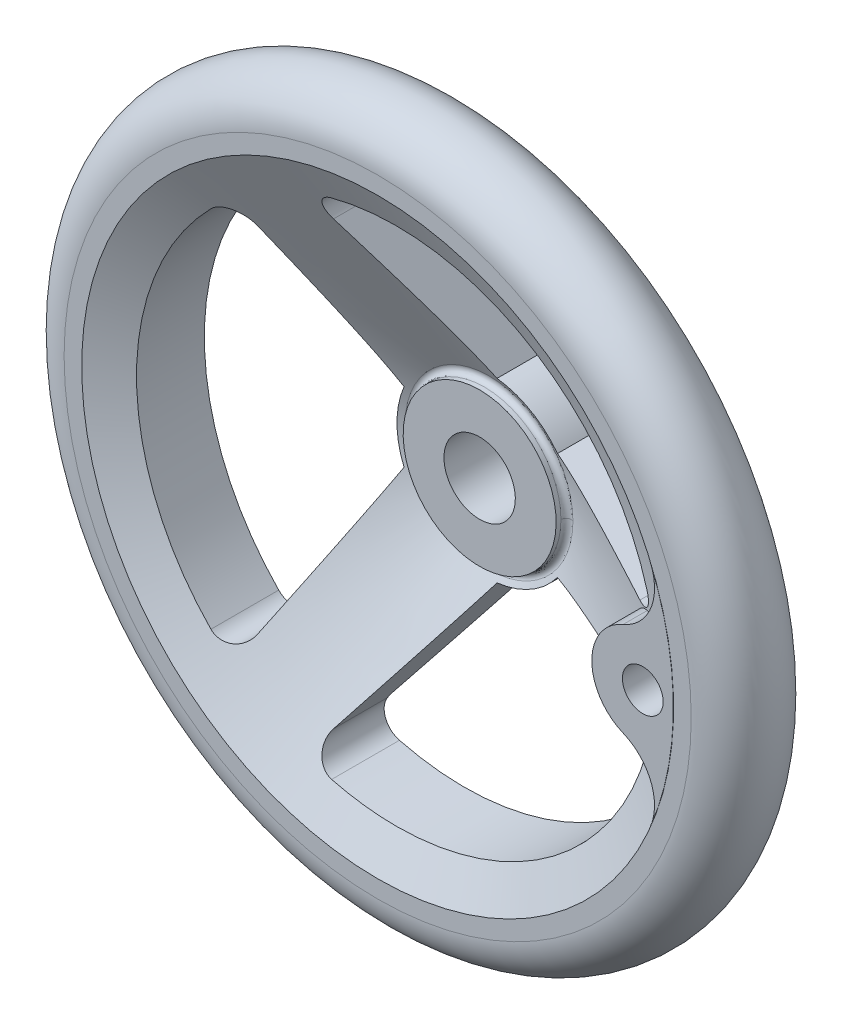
ISO-10303-21;
HEADER;
FILE_DESCRIPTION(('STEP AP214'),'2;1');
FILE_NAME('part.step','',(''),(''),'','','');
FILE_SCHEMA(('AUTOMOTIVE_DESIGN { 1 0 10303 214 1 1 1 1 }'));
ENDSEC;
DATA;
#1=APPLICATION_CONTEXT('core data for automotive mechanical design processes');
#2=APPLICATION_PROTOCOL_DEFINITION('international standard','automotive_design',2000,#1);
#3=PRODUCT_CONTEXT('',#1,'mechanical');
#4=PRODUCT('Part','Part','',(#3));
#5=PRODUCT_RELATED_PRODUCT_CATEGORY('part','',(#4));
#6=PRODUCT_DEFINITION_FORMATION('','',#4);
#7=PRODUCT_DEFINITION_CONTEXT('part definition',#1,'design');
#8=PRODUCT_DEFINITION('design','',#6,#7);
#9=PRODUCT_DEFINITION_SHAPE('','',#8);
#10=(LENGTH_UNIT() NAMED_UNIT(*) SI_UNIT(.MILLI.,.METRE.));
#11=(NAMED_UNIT(*) PLANE_ANGLE_UNIT() SI_UNIT($,.RADIAN.));
#12=(NAMED_UNIT(*) SI_UNIT($,.STERADIAN.) SOLID_ANGLE_UNIT());
#13=UNCERTAINTY_MEASURE_WITH_UNIT(LENGTH_MEASURE(1.E-05),#10,'distance_accuracy_value','');
#14=(GEOMETRIC_REPRESENTATION_CONTEXT(3) GLOBAL_UNCERTAINTY_ASSIGNED_CONTEXT((#13)) GLOBAL_UNIT_ASSIGNED_CONTEXT((#10,
#11,#12)) REPRESENTATION_CONTEXT('',''));
#15=CARTESIAN_POINT('',(0.,0.,0.));
#16=DIRECTION('',(0.,0.,1.));
#17=DIRECTION('',(1.,0.,0.));
#18=AXIS2_PLACEMENT_3D('',#15,#16,#17);
#19=CARTESIAN_POINT('',(0.,0.,0.));
#20=DIRECTION('',(0.,0.,1.));
#21=DIRECTION('',(0.,-1.,0.));
#22=AXIS2_PLACEMENT_3D('',#19,#20,#21);
#23=CYLINDRICAL_SURFACE('',#22,7.);
#24=CARTESIAN_POINT('',(0.,0.,19.000000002));
#25=DIRECTION('',(0.,0.,1.));
#26=DIRECTION('',(0.,-1.,0.));
#27=AXIS2_PLACEMENT_3D('',#24,#25,#26);
#28=CIRCLE('',#27,7.);
#29=CARTESIAN_POINT('',(0.,-7.,19.000000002));
#30=VERTEX_POINT('',#29);
#31=EDGE_CURVE('E201',#30,#30,#28,.T.);
#32=ORIENTED_EDGE('',*,*,#31,.T.);
#33=EDGE_LOOP('',(#32));
#34=FACE_BOUND('',#33,.T.);
#35=CARTESIAN_POINT('',(0.,0.,0.));
#36=DIRECTION('',(0.,0.,1.));
#37=DIRECTION('',(0.,-1.,0.));
#38=AXIS2_PLACEMENT_3D('',#35,#36,#37);
#39=CIRCLE('',#38,7.);
#40=CARTESIAN_POINT('',(0.,-7.,0.));
#41=VERTEX_POINT('',#40);
#42=EDGE_CURVE('E205',#41,#41,#39,.F.);
#43=ORIENTED_EDGE('',*,*,#42,.T.);
#44=EDGE_LOOP('',(#43));
#45=FACE_BOUND('',#44,.T.);
#46=ADVANCED_FACE('F15',(#34,#45),#23,.F.);
#47=CARTESIAN_POINT('',(-15.180469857,-15.23270539,0.));
#48=DIRECTION('',(0.,0.,1.));
#49=DIRECTION('',(1.,0.,0.));
#50=AXIS2_PLACEMENT_3D('',#47,#48,#49);
#51=PLANE('',#50);
#52=ORIENTED_EDGE('',*,*,#42,.F.);
#53=EDGE_LOOP('',(#52));
#54=FACE_BOUND('',#53,.T.);
#55=CARTESIAN_POINT('',(0.,0.,0.));
#56=DIRECTION('',(0.,0.,-1.));
#57=DIRECTION('',(-1.,0.,0.));
#58=AXIS2_PLACEMENT_3D('',#55,#56,#57);
#59=CIRCLE('',#58,16.);
#60=CARTESIAN_POINT('',(-16.,0.,0.));
#61=VERTEX_POINT('',#60);
#62=EDGE_CURVE('E208',#61,#61,#59,.T.);
#63=ORIENTED_EDGE('',*,*,#62,.T.);
#64=EDGE_LOOP('',(#63));
#65=FACE_BOUND('',#64,.T.);
#66=ADVANCED_FACE('F244',(#54,#65),#51,.F.);
#67=CARTESIAN_POINT('',(15.180469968,-15.2327055,19.000000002));
#68=DIRECTION('',(0.,0.,-1.));
#69=DIRECTION('',(-1.,0.,0.));
#70=AXIS2_PLACEMENT_3D('',#67,#68,#69);
#71=PLANE('',#70);
#72=ORIENTED_EDGE('',*,*,#31,.F.);
#73=EDGE_LOOP('',(#72));
#74=FACE_BOUND('',#73,.T.);
#75=CARTESIAN_POINT('',(0.,0.,19.000000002));
#76=DIRECTION('',(0.,0.,-1.));
#77=DIRECTION('',(0.,1.,0.));
#78=AXIS2_PLACEMENT_3D('',#75,#76,#77);
#79=CIRCLE('',#78,15.000464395);
#80=CARTESIAN_POINT('',(0.,15.000464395,19.000000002));
#81=VERTEX_POINT('',#80);
#82=EDGE_CURVE('E197',#81,#81,#79,.T.);
#83=ORIENTED_EDGE('',*,*,#82,.F.);
#84=EDGE_LOOP('',(#83));
#85=FACE_BOUND('',#84,.T.);
#86=ADVANCED_FACE('F247',(#74,#85),#71,.F.);
#87=CARTESIAN_POINT('',(44.307692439,18.461538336,34.236443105));
#88=DIRECTION('',(0.,0.,1.));
#89=DIRECTION('',(0.,-1.,0.));
#90=AXIS2_PLACEMENT_3D('',#87,#88,#89);
#91=CYLINDRICAL_SURFACE('',#90,10.);
#92=DIRECTION('',(0.,0.,-1.));
#93=VECTOR('',#92,1.);
#94=CARTESIAN_POINT('',(48.153846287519,9.2307691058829,34.7616407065));
#95=LINE('',#94,#93);
#96=CARTESIAN_POINT('',(48.1538462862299,9.23076910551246,39.));
#97=VERTEX_POINT('',#96);
#98=CARTESIAN_POINT('',(48.1538462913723,9.23076910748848,34.2648539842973));
#99=VERTEX_POINT('',#98);
#100=EDGE_CURVE('E166',#97,#99,#95,.T.);
#101=ORIENTED_EDGE('',*,*,#100,.F.);
#102=CARTESIAN_POINT('',(44.307692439,18.461538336,39.));
#103=DIRECTION('',(0.,0.,1.));
#104=DIRECTION('',(0.,-1.,0.));
#105=AXIS2_PLACEMENT_3D('',#102,#103,#104);
#106=CIRCLE('',#105,10.);
#107=CARTESIAN_POINT('',(53.5384616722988,22.3076921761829,39.));
#108=VERTEX_POINT('',#107);
#109=EDGE_CURVE('E163',#108,#97,#106,.F.);
#110=ORIENTED_EDGE('',*,*,#109,.F.);
#111=DIRECTION('',(0.,0.,1.));
#112=VECTOR('',#111,1.);
#113=CARTESIAN_POINT('',(53.5384616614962,22.3076922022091,38.9868613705));
#114=LINE('',#113,#112);
#115=CARTESIAN_POINT('',(53.5384616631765,22.3076921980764,38.9737227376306));
#116=VERTEX_POINT('',#115);
#117=EDGE_CURVE('E147',#116,#108,#114,.T.);
#118=ORIENTED_EDGE('',*,*,#117,.F.);
#119=CARTESIAN_POINT('',(53.5384616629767,22.3076921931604,38.9737227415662));
#120=CARTESIAN_POINT('',(53.63998359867,22.0641449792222,38.9737360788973));
#121=CARTESIAN_POINT('',(53.7317878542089,21.8165614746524,38.9691860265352));
#122=CARTESIAN_POINT('',(53.8954718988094,21.3152681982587,38.9510572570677));
#123=CARTESIAN_POINT('',(53.9673556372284,21.0615596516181,38.9374803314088));
#124=CARTESIAN_POINT('',(54.0905772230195,20.5505817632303,38.9014464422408));
#125=CARTESIAN_POINT('',(54.1419721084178,20.2933243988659,38.8790144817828));
#126=CARTESIAN_POINT('',(54.2243180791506,19.7764552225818,38.8254540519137));
#127=CARTESIAN_POINT('',(54.2552688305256,19.5168433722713,38.7943254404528));
#128=CARTESIAN_POINT('',(54.2967338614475,18.9972298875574,38.7236257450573));
#129=CARTESIAN_POINT('',(54.3072546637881,18.7372284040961,38.6840573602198));
#130=CARTESIAN_POINT('',(54.3081034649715,18.2185586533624,38.596769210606));
#131=CARTESIAN_POINT('',(54.2984303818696,17.9598904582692,38.5490490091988));
#132=CARTESIAN_POINT('',(54.2592909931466,17.4455515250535,38.4457873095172));
#133=CARTESIAN_POINT('',(54.22981820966,17.1898817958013,38.3902432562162));
#134=CARTESIAN_POINT('',(54.1516451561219,16.6832536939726,38.2717290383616));
#135=CARTESIAN_POINT('',(54.1029445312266,16.4322954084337,38.2087587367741));
#136=CARTESIAN_POINT('',(53.9852528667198,15.9290236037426,38.0737719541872));
#137=CARTESIAN_POINT('',(53.9156874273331,15.6769028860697,38.0015378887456));
#138=CARTESIAN_POINT('',(53.7577650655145,15.180692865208,37.8500696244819));
#139=CARTESIAN_POINT('',(53.6694017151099,14.936606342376,37.7708330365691));
#140=CARTESIAN_POINT('',(53.4749278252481,14.4579771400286,37.6058935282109));
#141=CARTESIAN_POINT('',(53.3688226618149,14.2234315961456,37.5201925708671));
#142=CARTESIAN_POINT('',(53.1398713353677,13.7649101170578,37.3427618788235));
#143=CARTESIAN_POINT('',(53.017017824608,13.5409388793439,37.2510295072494));
#144=CARTESIAN_POINT('',(52.7455751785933,13.0877877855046,37.0547263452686));
#145=CARTESIAN_POINT('',(52.5957286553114,12.8595528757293,36.9497117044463));
#146=CARTESIAN_POINT('',(52.279425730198,12.4179282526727,36.7339520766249));
#147=CARTESIAN_POINT('',(52.1129746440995,12.2045338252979,36.6232089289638));
#148=CARTESIAN_POINT('',(51.7646720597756,11.7932434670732,36.3964420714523));
#149=CARTESIAN_POINT('',(51.5828033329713,11.595365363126,36.280412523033));
#150=CARTESIAN_POINT('',(51.2053319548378,11.2162568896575,36.0438286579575));
#151=CARTESIAN_POINT('',(51.0097333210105,11.0350216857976,35.9232756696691));
#152=CARTESIAN_POINT('',(50.60734659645,10.6908207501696,35.6789144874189));
#153=CARTESIAN_POINT('',(50.4006295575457,10.5277556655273,35.5551290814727));
#154=CARTESIAN_POINT('',(49.9763432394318,10.2192569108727,35.3042101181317));
#155=CARTESIAN_POINT('',(49.7587733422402,10.0738242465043,35.1770763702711));
#156=CARTESIAN_POINT('',(49.3145990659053,9.80136407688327,34.9203080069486));
#157=CARTESIAN_POINT('',(49.0880145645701,9.67429865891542,34.7906791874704));
#158=CARTESIAN_POINT('',(48.6267154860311,9.4386146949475,34.5292552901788));
#159=CARTESIAN_POINT('',(48.3920024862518,9.32999259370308,34.3974606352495));
#160=CARTESIAN_POINT('',(48.1538462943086,9.23076910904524,34.2648539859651));
#161=B_SPLINE_CURVE_WITH_KNOTS('',3,(#119,#120,#121,#122,#123,#124,#125,#126,#127,#128,#129,
#130,#131,#132,#133,#134,#135,#136,#137,#138,#139,#140,#141,#142,#143,#144,#145,#146,#147,#148,
#149,#150,#151,#152,#153,#154,#155,#156,#157,#158,#159,#160),.UNSPECIFIED.,.F.,.F.,(4,2,2,2,2,2,
2,2,2,2,2,2,2,2,2,2,2,2,2,2,4),(0.,0.79131382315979,1.58247065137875,2.371409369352,
3.16036097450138,3.94906064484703,4.73780257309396,5.52680267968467,6.31581734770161,
7.12893550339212,7.94233215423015,8.75548277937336,9.56899130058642,10.445640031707,
11.3220090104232,12.1993705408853,13.0764764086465,13.9485229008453,14.8206191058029,
15.6908886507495,16.5609902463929),.UNSPECIFIED.);
#162=EDGE_CURVE('E181',#116,#99,#161,.T.);
#163=ORIENTED_EDGE('',*,*,#162,.T.);
#164=EDGE_LOOP('',(#101,#110,#118,#163));
#165=FACE_BOUND('',#164,.T.);
#166=ADVANCED_FACE('F164',(#165),#91,.F.);
#167=CARTESIAN_POINT('',(0.,0.,19.000000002));
#168=DIRECTION('',(0.,0.,-1.));
#169=DIRECTION('',(0.,1.,0.));
#170=AXIS2_PLACEMENT_3D('',#167,#168,#169);
#171=CYLINDRICAL_SURFACE('',#170,15.000464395);
#172=ORIENTED_EDGE('',*,*,#82,.T.);
#173=EDGE_LOOP('',(#172));
#174=FACE_BOUND('',#173,.T.);
#175=CARTESIAN_POINT('',(0.,0.,18.053702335));
#176=DIRECTION('',(0.,0.,1.));
#177=DIRECTION('',(0.,-1.,0.));
#178=AXIS2_PLACEMENT_3D('',#175,#176,#177);
#179=CIRCLE('',#178,15.000464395);
#180=CARTESIAN_POINT('',(-15.000464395,-6.734730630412E-10,18.053702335));
#181=VERTEX_POINT('',#180);
#182=CARTESIAN_POINT('',(15.000464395,-1.53832333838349E-09,18.053702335));
#183=VERTEX_POINT('',#182);
#184=EDGE_CURVE('E438',#181,#183,#179,.T.);
#185=ORIENTED_EDGE('',*,*,#184,.T.);
#186=CARTESIAN_POINT('',(0.,0.,18.053702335));
#187=DIRECTION('',(0.,0.,1.));
#188=DIRECTION('',(0.,-1.,0.));
#189=AXIS2_PLACEMENT_3D('',#186,#187,#188);
#190=CIRCLE('',#189,15.000464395);
#191=EDGE_CURVE('E171',#183,#181,#190,.T.);
#192=ORIENTED_EDGE('',*,*,#191,.T.);
#193=EDGE_LOOP('',(#185,#192));
#194=FACE_BOUND('',#193,.T.);
#195=ADVANCED_FACE('F605',(#174,#194),#171,.T.);
#196=CARTESIAN_POINT('',(-15.000464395,0.,18.053702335));
#197=CARTESIAN_POINT('',(-15.000464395,30.00092879,18.053702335));
#198=CARTESIAN_POINT('',(15.000464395,30.00092879,18.053702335));
#199=CARTESIAN_POINT('',(15.000464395,0.,18.053702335));
#200=CARTESIAN_POINT('',(-15.000464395,0.,17.212432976));
#201=CARTESIAN_POINT('',(-15.000464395,30.00092879,17.212432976));
#202=CARTESIAN_POINT('',(15.000464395,30.00092879,17.212432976));
#203=CARTESIAN_POINT('',(15.000464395,0.,17.212432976));
#204=CARTESIAN_POINT('',(-15.720432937,0.,16.777255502));
#205=CARTESIAN_POINT('',(-15.720432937,31.440865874,16.777255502));
#206=CARTESIAN_POINT('',(15.720432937,31.440865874,16.777255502));
#207=CARTESIAN_POINT('',(15.720432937,0.,16.777255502));
#208=CARTESIAN_POINT('',(-16.465293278,0.,17.168301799));
#209=CARTESIAN_POINT('',(-16.465293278,32.930586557,17.168301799));
#210=CARTESIAN_POINT('',(16.465293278,32.930586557,17.168301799));
#211=CARTESIAN_POINT('',(16.465293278,0.,17.168301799));
#212=(BOUNDED_SURFACE() B_SPLINE_SURFACE(3,3,((#196,#197,#198,#199),(#200,#201,#202,#203),(#204,
#205,#206,#207),(#208,#209,#210,#211)),.UNSPECIFIED.,.F.,.F.,
.F.) B_SPLINE_SURFACE_WITH_KNOTS((4,4),(4,4),(0.,1.),(0.,1.),
.UNSPECIFIED.) GEOMETRIC_REPRESENTATION_ITEM() RATIONAL_B_SPLINE_SURFACE(((1.,0.333333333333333,
0.333333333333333,1.),(0.678191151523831,0.22606371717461,0.22606371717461,0.678191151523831),
(0.678191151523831,0.22606371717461,0.22606371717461,0.678191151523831),(1.,0.333333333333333,
0.333333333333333,1.))) REPRESENTATION_ITEM('') SURFACE());
#213=CARTESIAN_POINT('',(0.,0.,17.168301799));
#214=DIRECTION('',(0.,0.,1.));
#215=DIRECTION('',(1.,0.,0.));
#216=AXIS2_PLACEMENT_3D('',#213,#214,#215);
#217=CIRCLE('',#216,16.465293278);
#218=CARTESIAN_POINT('',(16.465293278,-2.21771763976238E-09,17.168301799));
#219=VERTEX_POINT('',#218);
#220=CARTESIAN_POINT('',(-16.465293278,-4.22136012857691E-09,17.168301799));
#221=VERTEX_POINT('',#220);
#222=EDGE_CURVE('E453',#219,#221,#217,.T.);
#223=CARTESIAN_POINT('',(-15.000464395,0.,18.053702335));
#224=CARTESIAN_POINT('',(-15.000464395,0.,17.212432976));
#225=CARTESIAN_POINT('',(-15.720432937,0.,16.777255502));
#226=CARTESIAN_POINT('',(-16.465293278,0.,17.168301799));
#227=(BOUNDED_CURVE() B_SPLINE_CURVE(3,(#223,#224,#225,#226),.UNSPECIFIED.,.F.,
.F.) B_SPLINE_CURVE_WITH_KNOTS((4,4),(0.,1.),
.UNSPECIFIED.) CURVE() GEOMETRIC_REPRESENTATION_ITEM() RATIONAL_B_SPLINE_CURVE((1.,
0.67819115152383,0.67819115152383,1.)) REPRESENTATION_ITEM(''));
#228=EDGE_CURVE('E447',#221,#181,#227,.F.);
#229=CARTESIAN_POINT('',(15.000464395,0.,18.053702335));
#230=CARTESIAN_POINT('',(15.000464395,0.,17.212432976));
#231=CARTESIAN_POINT('',(15.720432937,0.,16.777255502));
#232=CARTESIAN_POINT('',(16.465293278,0.,17.168301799));
#233=(BOUNDED_CURVE() B_SPLINE_CURVE(3,(#229,#230,#231,#232),.UNSPECIFIED.,.F.,
.F.) B_SPLINE_CURVE_WITH_KNOTS((4,4),(0.,1.),
.UNSPECIFIED.) CURVE() GEOMETRIC_REPRESENTATION_ITEM() RATIONAL_B_SPLINE_CURVE((1.,
0.67819115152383,0.67819115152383,1.)) REPRESENTATION_ITEM(''));
#234=EDGE_CURVE('E433',#183,#219,#233,.T.);
#235=ORIENTED_EDGE('',*,*,#222,.T.);
#236=ORIENTED_EDGE('',*,*,#228,.T.);
#237=ORIENTED_EDGE('',*,*,#191,.F.);
#238=ORIENTED_EDGE('',*,*,#234,.T.);
#239=EDGE_LOOP('',(#235,#236,#237,#238));
#240=FACE_BOUND('',#239,.T.);
#241=ADVANCED_FACE('F255',(#240),#212,.F.);
#242=CARTESIAN_POINT('',(41.874692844,22.57538449,39.));
#243=DIRECTION('',(0.,0.,1.));
#244=DIRECTION('',(0.,-1.,0.));
#245=AXIS2_PLACEMENT_3D('',#242,#243,#244);
#246=PLANE('',#245);
#247=CARTESIAN_POINT('',(52.,0.,39.));
#248=DIRECTION('',(0.,0.,1.));
#249=DIRECTION('',(0.,-1.,0.));
#250=AXIS2_PLACEMENT_3D('',#247,#248,#249);
#251=CIRCLE('',#250,4.);
#252=CARTESIAN_POINT('',(52.,-4.,39.));
#253=VERTEX_POINT('',#252);
#254=EDGE_CURVE('E426',#253,#253,#251,.F.);
#255=ORIENTED_EDGE('',*,*,#254,.T.);
#256=EDGE_LOOP('',(#255));
#257=FACE_BOUND('',#256,.T.);
#258=CARTESIAN_POINT('',(44.30769235,-18.46153855,39.));
#259=DIRECTION('',(0.,0.,1.));
#260=DIRECTION('',(0.,-1.,0.));
#261=AXIS2_PLACEMENT_3D('',#258,#259,#260);
#262=CIRCLE('',#261,10.);
#263=CARTESIAN_POINT('',(48.1538462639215,-9.23076934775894,39.));
#264=VERTEX_POINT('',#263);
#265=CARTESIAN_POINT('',(53.5384615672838,-22.3076924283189,39.));
#266=VERTEX_POINT('',#265);
#267=EDGE_CURVE('E159',#264,#266,#262,.F.);
#268=ORIENTED_EDGE('',*,*,#267,.T.);
#269=CARTESIAN_POINT('',(0.,0.,39.));
#270=DIRECTION('',(0.,0.,1.));
#271=DIRECTION('',(1.,0.,0.));
#272=AXIS2_PLACEMENT_3D('',#269,#270,#271);
#273=CIRCLE('',#272,58.000000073);
#274=EDGE_CURVE('E151',#108,#266,#273,.F.);
#275=ORIENTED_EDGE('',*,*,#274,.F.);
#276=ORIENTED_EDGE('',*,*,#109,.T.);
#277=CARTESIAN_POINT('',(52.000000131,-1.26000000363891E-07,39.));
#278=DIRECTION('',(0.,0.,1.));
#279=DIRECTION('',(1.,0.,0.));
#280=AXIS2_PLACEMENT_3D('',#277,#278,#279);
#281=CIRCLE('',#280,10.);
#282=EDGE_CURVE('E170',#264,#97,#281,.F.);
#283=ORIENTED_EDGE('',*,*,#282,.F.);
#284=EDGE_LOOP('',(#268,#275,#276,#283));
#285=FACE_BOUND('',#284,.T.);
#286=ADVANCED_FACE('F173',(#257,#285),#246,.T.);
#287=CARTESIAN_POINT('',(0.,0.,6.153148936));
#288=DIRECTION('',(0.,0.,1.));
#289=DIRECTION('',(0.,-1.,0.));
#290=AXIS2_PLACEMENT_3D('',#287,#288,#289);
#291=CYLINDRICAL_SURFACE('',#290,17.5);
#292=DIRECTION('',(0.,0.,1.));
#293=VECTOR('',#292,1.);
#294=CARTESIAN_POINT('',(2.126831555,17.370278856,19.3735816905));
#295=LINE('',#294,#293);
#296=CARTESIAN_POINT('',(2.126831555,17.370278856,6.15314893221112));
#297=VERTEX_POINT('',#296);
#298=CARTESIAN_POINT('',(2.12683156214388,17.3702788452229,17.7115153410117));
#299=VERTEX_POINT('',#298);
#300=EDGE_CURVE('E560',#297,#299,#295,.T.);
#301=ORIENTED_EDGE('',*,*,#300,.T.);
#302=CARTESIAN_POINT('',(0.,0.,17.7115153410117));
#303=DIRECTION('',(0.,0.,1.));
#304=DIRECTION('',(1.,0.,0.));
#305=AXIS2_PLACEMENT_3D('',#302,#303,#304);
#306=CIRCLE('',#305,17.4999999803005);
#307=CARTESIAN_POINT('',(13.9796869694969,10.5270295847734,17.711515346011));
#308=VERTEX_POINT('',#307);
#309=EDGE_CURVE('E469',#299,#308,#306,.F.);
#310=ORIENTED_EDGE('',*,*,#309,.T.);
#311=DIRECTION('',(0.,0.,-1.));
#312=VECTOR('',#311,1.);
#313=CARTESIAN_POINT('',(13.979686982,10.527029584,19.373581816));
#314=LINE('',#313,#312);
#315=CARTESIAN_POINT('',(13.9796869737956,10.5270295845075,6.15314893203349));
#316=VERTEX_POINT('',#315);
#317=EDGE_CURVE('E551',#308,#316,#314,.T.);
#318=ORIENTED_EDGE('',*,*,#317,.T.);
#319=CARTESIAN_POINT('',(0.,0.,6.15314892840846));
#320=DIRECTION('',(0.,0.,1.));
#321=DIRECTION('',(1.,0.,0.));
#322=AXIS2_PLACEMENT_3D('',#319,#320,#321);
#323=CIRCLE('',#322,17.4999999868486);
#324=EDGE_CURVE('E466',#297,#316,#323,.F.);
#325=ORIENTED_EDGE('',*,*,#324,.F.);
#326=EDGE_LOOP('',(#301,#310,#318,#325));
#327=FACE_BOUND('',#326,.T.);
#328=ADVANCED_FACE('F254',(#327),#291,.T.);
#329=CARTESIAN_POINT('',(52.000000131,-1.26000000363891E-07,30.523281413));
#330=DIRECTION('',(0.,0.,1.));
#331=DIRECTION('',(1.,0.,0.));
#332=AXIS2_PLACEMENT_3D('',#329,#330,#331);
#333=CYLINDRICAL_SURFACE('',#332,10.);
#334=ORIENTED_EDGE('',*,*,#100,.T.);
#335=CARTESIAN_POINT('',(48.1538462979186,9.230769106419,34.2648539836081));
#336=CARTESIAN_POINT('',(47.8817816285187,9.11741160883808,34.1133862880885));
#337=CARTESIAN_POINT('',(47.6141627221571,8.99178376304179,33.9630283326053));
#338=CARTESIAN_POINT('',(47.08950088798,8.71635323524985,33.6656922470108));
#339=CARTESIAN_POINT('',(46.8324632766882,8.56653858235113,33.5187158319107));
#340=CARTESIAN_POINT('',(46.3290000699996,8.24197456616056,33.2283474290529));
#341=CARTESIAN_POINT('',(46.0826709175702,8.06704287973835,33.0849915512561));
#342=CARTESIAN_POINT('',(45.6047503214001,7.69368013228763,32.8045060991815));
#343=CARTESIAN_POINT('',(45.3731568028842,7.49525239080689,32.6673756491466));
#344=CARTESIAN_POINT('',(44.9259543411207,7.07477270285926,32.4004306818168));
#345=CARTESIAN_POINT('',(44.7104063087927,6.85263782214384,32.2706444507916));
#346=CARTESIAN_POINT('',(44.298517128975,6.38622953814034,32.020735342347));
#347=CARTESIAN_POINT('',(44.1021734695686,6.14195903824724,31.9006112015));
#348=CARTESIAN_POINT('',(43.7316225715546,5.6331773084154,31.6723103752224));
#349=CARTESIAN_POINT('',(43.5573522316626,5.36872740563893,31.5640997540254));
#350=CARTESIAN_POINT('',(43.2328350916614,4.82059708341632,31.3613404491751));
#351=CARTESIAN_POINT('',(43.0825788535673,4.53692428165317,31.2667863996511));
#352=CARTESIAN_POINT('',(42.8433747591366,4.02669131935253,31.1154670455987));
#353=CARTESIAN_POINT('',(42.7485447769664,3.80390435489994,31.0552011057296));
#354=CARTESIAN_POINT('',(42.5746680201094,3.34994820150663,30.9443245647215));
#355=CARTESIAN_POINT('',(42.4956177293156,3.11878089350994,30.8937118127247));
#356=CARTESIAN_POINT('',(42.3543470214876,2.64976633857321,30.8030163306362));
#357=CARTESIAN_POINT('',(42.2920990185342,2.41193075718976,30.7629163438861));
#358=CARTESIAN_POINT('',(42.1850875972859,1.93085005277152,30.6938441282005));
#359=CARTESIAN_POINT('',(42.1403177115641,1.6876069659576,30.6648677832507));
#360=CARTESIAN_POINT('',(42.0698880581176,1.20446558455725,30.6192296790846));
#361=CARTESIAN_POINT('',(42.0437134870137,0.9646737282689,30.6022362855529));
#362=CARTESIAN_POINT('',(42.0087681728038,0.48325613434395,30.5795397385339));
#363=CARTESIAN_POINT('',(41.9999998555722,0.241630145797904,30.5738381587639));
#364=CARTESIAN_POINT('',(42.000000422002,-0.249911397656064,30.5738386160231));
#365=CARTESIAN_POINT('',(42.0093806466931,-0.499827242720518,30.5799381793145));
#366=CARTESIAN_POINT('',(42.0467679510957,-0.997764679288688,30.6042194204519));
#367=CARTESIAN_POINT('',(42.0747825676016,-1.24578546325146,30.6224059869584));
#368=CARTESIAN_POINT('',(42.1490872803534,-1.73828349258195,30.6705447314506));
#369=CARTESIAN_POINT('',(42.195404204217,-1.98275498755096,30.7005141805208));
#370=CARTESIAN_POINT('',(42.3056656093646,-2.46603289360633,30.7716594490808));
#371=CARTESIAN_POINT('',(42.3696115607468,-2.70483883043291,30.8128362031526));
#372=CARTESIAN_POINT('',(42.513961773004,-3.17412584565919,30.9054633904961));
#373=CARTESIAN_POINT('',(42.5942896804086,-3.40463991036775,30.9568661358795));
#374=CARTESIAN_POINT('',(42.7706303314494,-3.85716342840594,31.0692472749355));
#375=CARTESIAN_POINT('',(42.8666433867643,-4.07917271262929,31.130225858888));
#376=CARTESIAN_POINT('',(43.0732807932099,-4.51347858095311,31.260854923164));
#377=CARTESIAN_POINT('',(43.1838983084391,-4.72577964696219,31.3305013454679));
#378=CARTESIAN_POINT('',(43.4187645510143,-5.13995176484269,31.4776229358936));
#379=CARTESIAN_POINT('',(43.5430181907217,-5.3418190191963,31.5551009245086));
#380=CARTESIAN_POINT('',(43.8131359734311,-5.74793558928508,31.7226053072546));
#381=CARTESIAN_POINT('',(43.959900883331,-5.95138118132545,31.8131291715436));
#382=CARTESIAN_POINT('',(44.2665603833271,-6.34477568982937,32.001090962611));
#383=CARTESIAN_POINT('',(44.4264596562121,-6.53471974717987,32.0985313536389));
#384=CARTESIAN_POINT('',(44.9242666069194,-7.08363798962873,32.3998848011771));
#385=CARTESIAN_POINT('',(45.280226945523,-7.42161427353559,32.6127949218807));
#386=CARTESIAN_POINT('',(46.0380106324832,-8.0436044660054,33.0595515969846));
#387=CARTESIAN_POINT('',(46.4405687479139,-8.32648780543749,33.2937158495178));
#388=CARTESIAN_POINT('',(47.0674441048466,-8.70224753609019,33.6529655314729));
#389=CARTESIAN_POINT('',(47.2799857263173,-8.81930020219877,33.773906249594));
#390=CARTESIAN_POINT('',(47.7119558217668,-9.03720805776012,34.017920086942));
#391=CARTESIAN_POINT('',(47.9313825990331,-9.13806720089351,34.1409926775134));
#392=CARTESIAN_POINT('',(48.1538462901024,-9.23076935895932,34.2648540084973));
#393=B_SPLINE_CURVE_WITH_KNOTS('',3,(#335,#336,#337,#338,#339,#340,#341,#342,#343,#344,#345,
#346,#347,#348,#349,#350,#351,#352,#353,#354,#355,#356,#357,#358,#359,#360,#361,#362,#363,#364,
#365,#366,#367,#368,#369,#370,#371,#372,#373,#374,#375,#376,#377,#378,#379,#380,#381,#382,#383,
#384,#385,#386,#387,#388,#389,#390,#391,#392),.UNSPECIFIED.,.F.,.F.,(4,2,2,2,2,2,2,2,2,2,2,2,2,
2,2,2,2,2,2,2,2,2,2,2,2,2,2,2,4),(0.,0.99393749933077,1.98836845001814,2.99042173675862,
3.99233362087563,4.99787309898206,6.00328087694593,7.00574629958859,8.00781676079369,
8.75561065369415,9.5032377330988,10.2496297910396,10.9957453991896,11.7203021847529,
12.4449599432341,13.1944534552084,13.9442502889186,14.695150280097,15.4461129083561,
16.1936522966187,16.9412065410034,17.6884121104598,18.435887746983,19.2351440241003,
20.0346865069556,21.6340897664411,23.2634807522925,24.0763166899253,24.8889538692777),.UNSPECIFIED.);
#394=CARTESIAN_POINT('',(48.1538462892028,-9.23076935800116,34.2648540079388));
#395=VERTEX_POINT('',#394);
#396=EDGE_CURVE('E348',#99,#395,#393,.T.);
#397=ORIENTED_EDGE('',*,*,#396,.T.);
#398=DIRECTION('',(0.,0.,1.));
#399=VECTOR('',#398,1.);
#400=CARTESIAN_POINT('',(48.1538462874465,-9.23076935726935,36.618221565));
#401=LINE('',#400,#399);
#402=EDGE_CURVE('E194',#395,#264,#401,.T.);
#403=ORIENTED_EDGE('',*,*,#402,.T.);
#404=ORIENTED_EDGE('',*,*,#282,.T.);
#405=EDGE_LOOP('',(#334,#397,#403,#404));
#406=FACE_BOUND('',#405,.T.);
#407=ADVANCED_FACE('F619',(#406),#333,.T.);
#408=CARTESIAN_POINT('',(44.30769235,-18.46153855,34.23644313));
#409=DIRECTION('',(0.,0.,1.));
#410=DIRECTION('',(0.,-1.,0.));
#411=AXIS2_PLACEMENT_3D('',#408,#409,#410);
#412=CYLINDRICAL_SURFACE('',#411,10.);
#413=DIRECTION('',(0.,0.,-1.));
#414=VECTOR('',#413,1.);
#415=CARTESIAN_POINT('',(53.5384615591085,-22.3076924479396,38.9868613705));
#416=LINE('',#415,#414);
#417=CARTESIAN_POINT('',(53.5384615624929,-22.3076924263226,38.9737227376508));
#418=VERTEX_POINT('',#417);
#419=EDGE_CURVE('E177',#266,#418,#416,.T.);
#420=ORIENTED_EDGE('',*,*,#419,.F.);
#421=ORIENTED_EDGE('',*,*,#267,.F.);
#422=ORIENTED_EDGE('',*,*,#402,.F.);
#423=CARTESIAN_POINT('',(48.1538462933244,-9.2307693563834,34.264854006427));
#424=CARTESIAN_POINT('',(48.4316873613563,-9.34652045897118,34.4195601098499));
#425=CARTESIAN_POINT('',(48.7048483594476,-9.47507550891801,34.5731608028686));
#426=CARTESIAN_POINT('',(49.2398455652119,-9.75721332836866,34.8773022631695));
#427=CARTESIAN_POINT('',(49.5016780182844,-9.9108043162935,35.0278420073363));
#428=CARTESIAN_POINT('',(50.0127750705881,-10.2429463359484,35.3254376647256));
#429=CARTESIAN_POINT('',(50.2619916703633,-10.4215841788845,35.4724792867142));
#430=CARTESIAN_POINT('',(50.7446650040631,-10.8025636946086,35.7615930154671));
#431=CARTESIAN_POINT('',(50.9781233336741,-11.0049029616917,35.9036656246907));
#432=CARTESIAN_POINT('',(51.4276748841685,-11.4328541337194,36.1822936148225));
#433=CARTESIAN_POINT('',(51.6437213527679,-11.6585252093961,36.3188336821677));
#434=CARTESIAN_POINT('',(52.0554786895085,-12.131444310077,36.5850463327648));
#435=CARTESIAN_POINT('',(52.2511907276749,-12.378691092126,36.7147193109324));
#436=CARTESIAN_POINT('',(52.6197272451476,-12.8928780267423,36.9660550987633));
#437=CARTESIAN_POINT('',(52.7925846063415,-13.1597890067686,37.0877292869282));
#438=CARTESIAN_POINT('',(53.1134692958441,-13.7117828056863,37.3222883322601));
#439=CARTESIAN_POINT('',(53.2614991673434,-13.9968637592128,37.4351740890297));
#440=CARTESIAN_POINT('',(53.5204557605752,-14.5610289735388,37.6430731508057));
#441=CARTESIAN_POINT('',(53.6333328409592,-14.8389586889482,37.7387919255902));
#442=CARTESIAN_POINT('',(53.8343574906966,-15.4065011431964,37.921102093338));
#443=CARTESIAN_POINT('',(53.9225079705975,-15.6961125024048,38.0076945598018));
#444=CARTESIAN_POINT('',(54.0726364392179,-16.2848078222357,38.1710229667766));
#445=CARTESIAN_POINT('',(54.1346108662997,-16.583893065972,38.2477575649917));
#446=CARTESIAN_POINT('',(54.2311136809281,-17.188933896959,38.390638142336));
#447=CARTESIAN_POINT('',(54.2656455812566,-17.4948885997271,38.4567854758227));
#448=CARTESIAN_POINT('',(54.3043509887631,-18.0812128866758,38.572014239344));
#449=CARTESIAN_POINT('',(54.3111265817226,-18.3612106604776,38.622125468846));
#450=CARTESIAN_POINT('',(54.3010097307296,-18.9223174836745,38.7127442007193));
#451=CARTESIAN_POINT('',(54.2841201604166,-19.2034263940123,38.7532528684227));
#452=CARTESIAN_POINT('',(54.2265072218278,-19.7639889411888,38.8242517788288));
#453=CARTESIAN_POINT('',(54.1858231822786,-20.0434445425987,38.8547584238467));
#454=CARTESIAN_POINT('',(54.0807366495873,-20.5986802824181,38.9055524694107));
#455=CARTESIAN_POINT('',(54.0163467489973,-20.8744622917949,38.9258452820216));
#456=CARTESIAN_POINT('',(53.8852957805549,-21.3444994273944,38.9518608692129));
#457=CARTESIAN_POINT('',(53.8241974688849,-21.5401900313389,38.9600618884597));
#458=CARTESIAN_POINT('',(53.6901528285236,-21.927281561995,38.9709902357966));
#459=CARTESIAN_POINT('',(53.6172252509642,-22.1186887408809,38.9737261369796));
#460=CARTESIAN_POINT('',(53.5384615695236,-22.3076924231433,38.973722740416));
#461=B_SPLINE_CURVE_WITH_KNOTS('',3,(#423,#424,#425,#426,#427,#428,#429,#430,#431,#432,#433,
#434,#435,#436,#437,#438,#439,#440,#441,#442,#443,#444,#445,#446,#447,#448,#449,#450,#451,#452,
#453,#454,#455,#456,#457,#458,#459,#460),.UNSPECIFIED.,.F.,.F.,(4,2,2,2,2,2,2,2,2,2,2,2,2,2,2,2,
2,2,4),(0.,1.01503292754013,2.03039972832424,3.04937698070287,4.06825089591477,5.0897752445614,
6.11124078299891,7.13122032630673,8.15109532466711,9.09445981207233,10.0377132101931,
10.9810949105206,11.9243558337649,12.7768280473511,13.6291967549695,14.4801605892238,
15.3306730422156,15.9457489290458,16.5598591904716),.UNSPECIFIED.);
#462=EDGE_CURVE('E498',#395,#418,#461,.T.);
#463=ORIENTED_EDGE('',*,*,#462,.T.);
#464=EDGE_LOOP('',(#420,#421,#422,#463));
#465=FACE_BOUND('',#464,.T.);
#466=ADVANCED_FACE('F624',(#465),#412,.F.);
#467=CARTESIAN_POINT('',(0.,0.,38.973722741));
#468=DIRECTION('',(0.,0.,1.));
#469=DIRECTION('',(1.,0.,0.));
#470=AXIS2_PLACEMENT_3D('',#467,#468,#469);
#471=CYLINDRICAL_SURFACE('',#470,58.000000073);
#472=ORIENTED_EDGE('',*,*,#419,.T.);
#473=CARTESIAN_POINT('',(0.,0.,38.973722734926));
#474=DIRECTION('',(0.,0.,1.));
#475=DIRECTION('',(1.,0.,0.));
#476=AXIS2_PLACEMENT_3D('',#473,#474,#475);
#477=CIRCLE('',#476,58.0000000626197);
#478=EDGE_CURVE('E154',#418,#116,#477,.T.);
#479=ORIENTED_EDGE('',*,*,#478,.T.);
#480=ORIENTED_EDGE('',*,*,#117,.T.);
#481=ORIENTED_EDGE('',*,*,#274,.T.);
#482=EDGE_LOOP('',(#472,#479,#480,#481));
#483=FACE_BOUND('',#482,.T.);
#484=ADVANCED_FACE('F149',(#483),#471,.T.);
#485=CARTESIAN_POINT('',(62.238469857,-62.452630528,39.));
#486=DIRECTION('',(0.,0.,-1.));
#487=DIRECTION('',(-1.,0.,0.));
#488=AXIS2_PLACEMENT_3D('',#485,#486,#487);
#489=PLANE('',#488);
#490=CARTESIAN_POINT('',(0.,0.,39.));
#491=DIRECTION('',(0.,0.,1.));
#492=DIRECTION('',(0.,-1.,0.));
#493=AXIS2_PLACEMENT_3D('',#490,#491,#492);
#494=CIRCLE('',#493,58.050052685);
#495=CARTESIAN_POINT('',(0.,-58.050052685,39.));
#496=VERTEX_POINT('',#495);
#497=EDGE_CURVE('E387',#496,#496,#494,.F.);
#498=ORIENTED_EDGE('',*,*,#497,.T.);
#499=EDGE_LOOP('',(#498));
#500=FACE_BOUND('',#499,.T.);
#501=CARTESIAN_POINT('',(0.,0.,39.));
#502=DIRECTION('',(0.,0.,-1.));
#503=DIRECTION('',(0.,1.,0.));
#504=AXIS2_PLACEMENT_3D('',#501,#502,#503);
#505=CIRCLE('',#504,61.5004642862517);
#506=CARTESIAN_POINT('',(0.,61.5004642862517,39.));
#507=VERTEX_POINT('',#506);
#508=EDGE_CURVE('E430',#507,#507,#505,.T.);
#509=ORIENTED_EDGE('',*,*,#508,.F.);
#510=EDGE_LOOP('',(#509));
#511=FACE_BOUND('',#510,.T.);
#512=ADVANCED_FACE('F257',(#500,#511),#489,.F.);
#513=CARTESIAN_POINT('',(0.,0.,6.153149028));
#514=DIRECTION('',(0.,0.,1.));
#515=DIRECTION('',(0.,-1.,0.));
#516=AXIS2_PLACEMENT_3D('',#513,#514,#515);
#517=CYLINDRICAL_SURFACE('',#516,17.50000016);
#518=CARTESIAN_POINT('',(0.,0.,17.7115154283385));
#519=DIRECTION('',(0.,0.,1.));
#520=DIRECTION('',(1.,0.,0.));
#521=AXIS2_PLACEMENT_3D('',#518,#519,#520);
#522=CIRCLE('',#521,17.5000001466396);
#523=CARTESIAN_POINT('',(-16.106518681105,-6.84324932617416,17.7115154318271));
#524=VERTEX_POINT('',#523);
#525=CARTESIAN_POINT('',(-16.1065188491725,6.84324893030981,17.7115154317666));
#526=VERTEX_POINT('',#525);
#527=EDGE_CURVE('E376',#524,#526,#522,.F.);
#528=ORIENTED_EDGE('',*,*,#527,.T.);
#529=DIRECTION('',(0.,0.,-1.));
#530=VECTOR('',#529,1.);
#531=CARTESIAN_POINT('',(-16.106518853,6.843248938,19.3735818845));
#532=LINE('',#531,#530);
#533=CARTESIAN_POINT('',(-16.1065188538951,6.84324893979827,6.15314902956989));
#534=VERTEX_POINT('',#533);
#535=EDGE_CURVE('E565',#526,#534,#532,.T.);
#536=ORIENTED_EDGE('',*,*,#535,.T.);
#537=CARTESIAN_POINT('',(0.,0.,6.15314903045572));
#538=DIRECTION('',(0.,0.,1.));
#539=DIRECTION('',(1.,0.,0.));
#540=AXIS2_PLACEMENT_3D('',#537,#538,#539);
#541=CIRCLE('',#540,17.5000001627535);
#542=CARTESIAN_POINT('',(-16.106518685,-6.843249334,6.15314902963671));
#543=VERTEX_POINT('',#542);
#544=EDGE_CURVE('E347',#543,#534,#541,.F.);
#545=ORIENTED_EDGE('',*,*,#544,.F.);
#546=DIRECTION('',(0.,0.,1.));
#547=VECTOR('',#546,1.);
#548=CARTESIAN_POINT('',(-16.106518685,-6.843249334,19.373581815));
#549=LINE('',#548,#547);
#550=EDGE_CURVE('E528',#543,#524,#549,.T.);
#551=ORIENTED_EDGE('',*,*,#550,.T.);
#552=EDGE_LOOP('',(#528,#536,#545,#551));
#553=FACE_BOUND('',#552,.T.);
#554=ADVANCED_FACE('F260',(#553),#517,.T.);
#555=CARTESIAN_POINT('',(15.000464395,0.,18.053702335));
#556=CARTESIAN_POINT('',(15.000464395,-30.00092879,18.053702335));
#557=CARTESIAN_POINT('',(-15.000464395,-30.00092879,18.053702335));
#558=CARTESIAN_POINT('',(-15.000464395,0.,18.053702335));
#559=CARTESIAN_POINT('',(15.000464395,0.,17.212432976));
#560=CARTESIAN_POINT('',(15.000464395,-30.00092879,17.212432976));
#561=CARTESIAN_POINT('',(-15.000464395,-30.00092879,17.212432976));
#562=CARTESIAN_POINT('',(-15.000464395,0.,17.212432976));
#563=CARTESIAN_POINT('',(15.720432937,0.,16.777255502));
#564=CARTESIAN_POINT('',(15.720432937,-31.440865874,16.777255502));
#565=CARTESIAN_POINT('',(-15.720432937,-31.440865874,16.777255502));
#566=CARTESIAN_POINT('',(-15.720432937,0.,16.777255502));
#567=CARTESIAN_POINT('',(16.465293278,0.,17.168301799));
#568=CARTESIAN_POINT('',(16.465293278,-32.930586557,17.168301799));
#569=CARTESIAN_POINT('',(-16.465293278,-32.930586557,17.168301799));
#570=CARTESIAN_POINT('',(-16.465293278,0.,17.168301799));
#571=(BOUNDED_SURFACE() B_SPLINE_SURFACE(3,3,((#555,#556,#557,#558),(#559,#560,#561,#562),(#563,
#564,#565,#566),(#567,#568,#569,#570)),.UNSPECIFIED.,.F.,.F.,
.F.) B_SPLINE_SURFACE_WITH_KNOTS((4,4),(4,4),(0.,1.),(0.,1.),
.UNSPECIFIED.) GEOMETRIC_REPRESENTATION_ITEM() RATIONAL_B_SPLINE_SURFACE(((1.,0.333333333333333,
0.333333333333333,1.),(0.67819115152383,0.22606371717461,0.22606371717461,0.67819115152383),
(0.67819115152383,0.22606371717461,0.22606371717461,0.67819115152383),(1.,0.333333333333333,
0.333333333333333,1.))) REPRESENTATION_ITEM('') SURFACE());
#572=CARTESIAN_POINT('',(0.,0.,17.168301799));
#573=DIRECTION('',(0.,0.,1.));
#574=DIRECTION('',(1.,0.,0.));
#575=AXIS2_PLACEMENT_3D('',#572,#573,#574);
#576=CIRCLE('',#575,16.465293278);
#577=EDGE_CURVE('E367',#221,#219,#576,.T.);
#578=ORIENTED_EDGE('',*,*,#234,.F.);
#579=ORIENTED_EDGE('',*,*,#184,.F.);
#580=ORIENTED_EDGE('',*,*,#228,.F.);
#581=ORIENTED_EDGE('',*,*,#577,.T.);
#582=EDGE_LOOP('',(#578,#579,#580,#581));
#583=FACE_BOUND('',#582,.T.);
#584=ADVANCED_FACE('F649',(#583),#571,.F.);
#585=CARTESIAN_POINT('',(0.,0.,6.153148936));
#586=DIRECTION('',(0.,0.,1.));
#587=DIRECTION('',(0.,-1.,0.));
#588=AXIS2_PLACEMENT_3D('',#585,#586,#587);
#589=CYLINDRICAL_SURFACE('',#588,17.5);
#590=DIRECTION('',(0.,0.,1.));
#591=VECTOR('',#590,1.);
#592=CARTESIAN_POINT('',(13.979686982,-10.527029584,19.373581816));
#593=LINE('',#592,#591);
#594=CARTESIAN_POINT('',(13.9796869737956,-10.5270295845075,6.15314893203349));
#595=VERTEX_POINT('',#594);
#596=CARTESIAN_POINT('',(13.9796869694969,-10.5270295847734,17.711515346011));
#597=VERTEX_POINT('',#596);
#598=EDGE_CURVE('E346',#595,#597,#593,.T.);
#599=ORIENTED_EDGE('',*,*,#598,.T.);
#600=CARTESIAN_POINT('',(0.,0.,17.7115153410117));
#601=DIRECTION('',(0.,0.,1.));
#602=DIRECTION('',(1.,0.,0.));
#603=AXIS2_PLACEMENT_3D('',#600,#601,#602);
#604=CIRCLE('',#603,17.4999999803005);
#605=CARTESIAN_POINT('',(2.126831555,-17.370278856,17.7115153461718));
#606=VERTEX_POINT('',#605);
#607=EDGE_CURVE('E366',#597,#606,#604,.F.);
#608=ORIENTED_EDGE('',*,*,#607,.T.);
#609=DIRECTION('',(0.,0.,-1.));
#610=VECTOR('',#609,1.);
#611=CARTESIAN_POINT('',(2.126831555,-17.370278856,19.373581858));
#612=LINE('',#611,#610);
#613=CARTESIAN_POINT('',(2.12683155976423,-17.3702788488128,6.15314893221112));
#614=VERTEX_POINT('',#613);
#615=EDGE_CURVE('E524',#606,#614,#612,.T.);
#616=ORIENTED_EDGE('',*,*,#615,.T.);
#617=CARTESIAN_POINT('',(0.,0.,6.15314892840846));
#618=DIRECTION('',(0.,0.,1.));
#619=DIRECTION('',(1.,0.,0.));
#620=AXIS2_PLACEMENT_3D('',#617,#618,#619);
#621=CIRCLE('',#620,17.4999999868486);
#622=EDGE_CURVE('E296',#595,#614,#621,.F.);
#623=ORIENTED_EDGE('',*,*,#622,.F.);
#624=EDGE_LOOP('',(#599,#608,#616,#623));
#625=FACE_BOUND('',#624,.T.);
#626=ADVANCED_FACE('F266',(#625),#589,.T.);
#627=CARTESIAN_POINT('',(0.,0.,30.5));
#628=DIRECTION('',(0.,0.,-1.));
#629=DIRECTION('',(0.,1.,0.));
#630=AXIS2_PLACEMENT_3D('',#627,#628,#629);
#631=TOROIDAL_SURFACE('',#630,61.500464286,8.5);
#632=CARTESIAN_POINT('',(0.,0.,22.));
#633=DIRECTION('',(0.,0.,-1.));
#634=DIRECTION('',(0.,1.,0.));
#635=AXIS2_PLACEMENT_3D('',#632,#633,#634);
#636=CIRCLE('',#635,61.5004642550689);
#637=CARTESIAN_POINT('',(0.,61.5004642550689,22.));
#638=VERTEX_POINT('',#637);
#639=EDGE_CURVE('E520',#638,#638,#636,.F.);
#640=ORIENTED_EDGE('',*,*,#639,.T.);
#641=EDGE_LOOP('',(#640));
#642=FACE_BOUND('',#641,.T.);
#643=ORIENTED_EDGE('',*,*,#508,.T.);
#644=EDGE_LOOP('',(#643));
#645=FACE_BOUND('',#644,.T.);
#646=ADVANCED_FACE('F262',(#642,#645),#631,.T.);
#647=CARTESIAN_POINT('',(52.,0.,22.));
#648=DIRECTION('',(0.,0.,1.));
#649=DIRECTION('',(0.,-1.,0.));
#650=AXIS2_PLACEMENT_3D('',#647,#648,#649);
#651=CYLINDRICAL_SURFACE('',#650,4.);
#652=CARTESIAN_POINT('',(52.,0.,22.));
#653=DIRECTION('',(0.,0.,1.));
#654=DIRECTION('',(0.,-1.,0.));
#655=AXIS2_PLACEMENT_3D('',#652,#653,#654);
#656=CIRCLE('',#655,4.);
#657=CARTESIAN_POINT('',(52.,-4.,22.));
#658=VERTEX_POINT('',#657);
#659=EDGE_CURVE('E747',#658,#658,#656,.F.);
#660=ORIENTED_EDGE('',*,*,#659,.T.);
#661=EDGE_LOOP('',(#660));
#662=FACE_BOUND('',#661,.T.);
#663=ORIENTED_EDGE('',*,*,#254,.F.);
#664=EDGE_LOOP('',(#663));
#665=FACE_BOUND('',#664,.T.);
#666=ADVANCED_FACE('F265',(#662,#665),#651,.F.);
#667=CARTESIAN_POINT('',(0.,0.,22.));
#668=DIRECTION('',(0.,0.,1.));
#669=DIRECTION('',(0.,-1.,0.));
#670=AXIS2_PLACEMENT_3D('',#667,#668,#669);
#671=CYLINDRICAL_SURFACE('',#670,51.);
#672=CARTESIAN_POINT('',(0.,0.,22.));
#673=DIRECTION('',(0.,0.,1.));
#674=DIRECTION('',(0.,-1.,0.));
#675=AXIS2_PLACEMENT_3D('',#672,#673,#674);
#676=CIRCLE('',#675,51.);
#677=CARTESIAN_POINT('',(49.133587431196,-13.6707931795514,22.));
#678=VERTEX_POINT('',#677);
#679=CARTESIAN_POINT('',(-12.7275394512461,-49.3863315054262,22.));
#680=VERTEX_POINT('',#679);
#681=EDGE_CURVE('E743',#678,#680,#676,.F.);
#682=ORIENTED_EDGE('',*,*,#681,.T.);
#683=DIRECTION('',(0.,0.,1.));
#684=VECTOR('',#683,1.);
#685=CARTESIAN_POINT('',(-12.7275394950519,-49.3863314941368,28.6892829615));
#686=LINE('',#685,#684);
#687=CARTESIAN_POINT('',(-12.7275394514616,-49.3863315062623,35.2987732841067));
#688=VERTEX_POINT('',#687);
#689=EDGE_CURVE('E429',#680,#688,#686,.T.);
#690=ORIENTED_EDGE('',*,*,#689,.T.);
#691=CARTESIAN_POINT('',(0.,0.,35.29877328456));
#692=DIRECTION('',(0.,0.,1.));
#693=DIRECTION('',(1.,0.,0.));
#694=AXIS2_PLACEMENT_3D('',#691,#692,#693);
#695=CIRCLE('',#694,51.0000000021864);
#696=CARTESIAN_POINT('',(49.1335874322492,-13.6707931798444,35.2987732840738));
#697=VERTEX_POINT('',#696);
#698=EDGE_CURVE('E511',#688,#697,#695,.T.);
#699=ORIENTED_EDGE('',*,*,#698,.T.);
#700=DIRECTION('',(0.,0.,-1.));
#701=VECTOR('',#700,1.);
#702=CARTESIAN_POINT('',(49.1335874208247,-13.6707932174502,28.689282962));
#703=LINE('',#702,#701);
#704=EDGE_CURVE('E515',#697,#678,#703,.T.);
#705=ORIENTED_EDGE('',*,*,#704,.T.);
#706=EDGE_LOOP('',(#682,#690,#699,#705));
#707=FACE_BOUND('',#706,.T.);
#708=ADVANCED_FACE('F772',(#707),#671,.F.);
#709=CARTESIAN_POINT('',(-11.729301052,-45.512893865,22.));
#710=DIRECTION('',(0.,0.,1.));
#711=DIRECTION('',(0.,-1.,0.));
#712=AXIS2_PLACEMENT_3D('',#709,#710,#711);
#713=CYLINDRICAL_SURFACE('',#712,3.999999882);
#714=CARTESIAN_POINT('',(-11.729301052,-45.512893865,22.));
#715=DIRECTION('',(0.,0.,1.));
#716=DIRECTION('',(0.,-1.,0.));
#717=AXIS2_PLACEMENT_3D('',#714,#715,#716);
#718=CIRCLE('',#717,3.999999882);
#719=CARTESIAN_POINT('',(-15.0633191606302,-43.3028435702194,22.));
#720=VERTEX_POINT('',#719);
#721=EDGE_CURVE('E694',#680,#720,#718,.F.);
#722=ORIENTED_EDGE('',*,*,#721,.T.);
#723=DIRECTION('',(0.,0.,1.));
#724=VECTOR('',#723,1.);
#725=CARTESIAN_POINT('',(-15.063319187,-43.30284361,19.373581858));
#726=LINE('',#725,#724);
#727=CARTESIAN_POINT('',(-15.063319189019,-43.3028436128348,32.5940147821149));
#728=VERTEX_POINT('',#727);
#729=EDGE_CURVE('E575',#720,#728,#726,.T.);
#730=ORIENTED_EDGE('',*,*,#729,.T.);
#731=CARTESIAN_POINT('',(-15.063319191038,-43.3028436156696,32.5940147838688));
#732=CARTESIAN_POINT('',(-15.1335398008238,-43.4087910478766,32.6586628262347));
#733=CARTESIAN_POINT('',(-15.198508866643,-43.5177542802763,32.7239130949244));
#734=CARTESIAN_POINT('',(-15.3176630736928,-43.7409783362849,32.8551840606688));
#735=CARTESIAN_POINT('',(-15.3718486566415,-43.8552389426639,32.9212047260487));
#736=CARTESIAN_POINT('',(-15.5178405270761,-44.2049357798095,33.1198114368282));
#737=CARTESIAN_POINT('',(-15.5930476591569,-44.4472350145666,33.2529104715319));
#738=CARTESIAN_POINT('',(-15.6966095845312,-44.9431409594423,33.5166013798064));
#739=CARTESIAN_POINT('',(-15.7249481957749,-45.1967515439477,33.6471923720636));
#740=CARTESIAN_POINT('',(-15.7307852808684,-45.5798396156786,33.8382562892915));
#741=CARTESIAN_POINT('',(-15.7266101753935,-45.7080326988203,33.901164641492));
#742=CARTESIAN_POINT('',(-15.7058164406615,-45.964376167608,34.0249268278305));
#743=CARTESIAN_POINT('',(-15.6892036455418,-46.0925265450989,34.0857816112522));
#744=CARTESIAN_POINT('',(-15.6439216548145,-46.3446047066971,34.2034856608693));
#745=CARTESIAN_POINT('',(-15.6155589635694,-46.4685588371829,34.2603966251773));
#746=CARTESIAN_POINT('',(-15.5467376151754,-46.7143305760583,34.3713046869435));
#747=CARTESIAN_POINT('',(-15.5062851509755,-46.8361492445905,34.4253032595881));
#748=CARTESIAN_POINT('',(-15.4132476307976,-47.0765935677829,34.5299288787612));
#749=CARTESIAN_POINT('',(-15.3606608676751,-47.1952187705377,34.5805554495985));
#750=CARTESIAN_POINT('',(-15.2434727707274,-47.4279812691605,34.677891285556));
#751=CARTESIAN_POINT('',(-15.1788786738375,-47.5421212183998,34.7246028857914));
#752=CARTESIAN_POINT('',(-15.0444007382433,-47.7544140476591,34.8095065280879));
#753=CARTESIAN_POINT('',(-14.9755555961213,-47.8530700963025,34.8480869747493));
#754=CARTESIAN_POINT('',(-14.8284697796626,-48.0446371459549,34.9212094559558));
#755=CARTESIAN_POINT('',(-14.7502343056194,-48.1375512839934,34.9557537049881));
#756=CARTESIAN_POINT('',(-14.5847649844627,-48.316675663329,35.0204467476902));
#757=CARTESIAN_POINT('',(-14.4975306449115,-48.4028855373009,35.0505953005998));
#758=CARTESIAN_POINT('',(-14.3146580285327,-48.5675726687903,35.1061295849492));
#759=CARTESIAN_POINT('',(-14.219021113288,-48.6460511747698,35.1315160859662));
#760=CARTESIAN_POINT('',(-14.0311343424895,-48.7860772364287,35.1746665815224));
#761=CARTESIAN_POINT('',(-13.9396852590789,-48.8485372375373,35.1929637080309));
#762=CARTESIAN_POINT('',(-13.7513787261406,-48.9659368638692,35.2253384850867));
#763=CARTESIAN_POINT('',(-13.6545220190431,-49.0208775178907,35.2394167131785));
#764=CARTESIAN_POINT('',(-13.4563659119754,-49.1225505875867,35.2631679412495));
#765=CARTESIAN_POINT('',(-13.3550772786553,-49.1693016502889,35.2728510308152));
#766=CARTESIAN_POINT('',(-13.1487120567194,-49.2542445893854,35.2877410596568));
#767=CARTESIAN_POINT('',(-13.0436382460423,-49.2924426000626,35.2929512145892));
#768=CARTESIAN_POINT('',(-12.9024704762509,-49.3371582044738,35.2968564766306));
#769=CARTESIAN_POINT('',(-12.8676541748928,-49.3476657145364,35.2975756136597));
#770=CARTESIAN_POINT('',(-12.7977808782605,-49.3677178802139,35.2985336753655));
#771=CARTESIAN_POINT('',(-12.7627241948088,-49.3772635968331,35.298773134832));
#772=CARTESIAN_POINT('',(-12.7275394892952,-49.3863314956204,35.2987732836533));
#773=B_SPLINE_CURVE_WITH_KNOTS('',3,(#731,#732,#733,#734,#735,#736,#737,#738,#739,#740,#741,
#742,#743,#744,#745,#746,#747,#748,#749,#750,#751,#752,#753,#754,#755,#756,#757,#758,#759,#760,
#761,#762,#763,#764,#765,#766,#767,#768,#769,#770,#771,#772),.UNSPECIFIED.,.F.,.F.,(4,2,2,2,2,2,
2,2,2,2,2,2,2,2,2,2,2,2,2,2,4),(0.,0.427536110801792,0.855054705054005,1.710298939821,
2.5658383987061,2.99394996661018,3.42186084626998,3.83924965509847,4.25642502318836,
4.67365911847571,5.09064255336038,5.46913460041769,5.84741800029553,6.22572211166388,
6.6039650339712,6.94025706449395,7.2765030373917,7.61197316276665,7.94720191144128,
8.05631328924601,8.16530295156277),.UNSPECIFIED.);
#774=EDGE_CURVE('E516',#728,#688,#773,.T.);
#775=ORIENTED_EDGE('',*,*,#774,.T.);
#776=ORIENTED_EDGE('',*,*,#689,.F.);
#777=EDGE_LOOP('',(#722,#730,#775,#776));
#778=FACE_BOUND('',#777,.T.);
#779=ADVANCED_FACE('F273',(#778),#713,.F.);
#780=CARTESIAN_POINT('',(2.126831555,-17.370278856,5.99450374));
#781=DIRECTION('',(-0.833504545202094,0.552512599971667,0.));
#782=DIRECTION('',(-0.552512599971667,-0.833504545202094,0.));
#783=AXIS2_PLACEMENT_3D('',#780,#781,#782);
#784=PLANE('',#783);
#785=DIRECTION('',(-0.552512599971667,-0.833504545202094,0.));
#786=VECTOR('',#785,1.);
#787=CARTESIAN_POINT('',(2.126831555,-17.370278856,22.));
#788=LINE('',#787,#786);
#789=CARTESIAN_POINT('',(-14.4743648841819,-42.4143641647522,21.9999999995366));
#790=VERTEX_POINT('',#789);
#791=EDGE_CURVE('E738',#720,#790,#788,.F.);
#792=ORIENTED_EDGE('',*,*,#791,.T.);
#793=CARTESIAN_POINT('',(2.12683155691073,-17.3702788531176,6.1531489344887));
#794=CARTESIAN_POINT('',(1.92873248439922,-17.6691253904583,6.31128923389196));
#795=CARTESIAN_POINT('',(1.73117830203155,-17.9671499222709,6.4716467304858));
#796=CARTESIAN_POINT('',(1.33704625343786,-18.5617261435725,6.79621706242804));
#797=CARTESIAN_POINT('',(1.14046835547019,-18.8582778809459,6.9604297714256));
#798=CARTESIAN_POINT('',(0.748187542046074,-19.4500613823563,7.2921206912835));
#799=CARTESIAN_POINT('',(0.5524845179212,-19.7452933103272,7.45959848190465));
#800=CARTESIAN_POINT('',(0.161827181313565,-20.3346276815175,7.79739601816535));
#801=CARTESIAN_POINT('',(-0.033127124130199,-20.628730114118,7.96771579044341));
#802=CARTESIAN_POINT('',(-0.6168733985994,-21.5093528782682,8.48223716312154));
#803=CARTESIAN_POINT('',(-1.00467773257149,-22.0943832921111,8.83011053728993));
#804=CARTESIAN_POINT('',(-1.7782284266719,-23.2613395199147,9.53331413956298));
#805=CARTESIAN_POINT('',(-2.16397470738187,-23.8432652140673,9.88864465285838));
#806=CARTESIAN_POINT('',(-2.93364456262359,-25.0043669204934,10.6049408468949));
#807=CARTESIAN_POINT('',(-3.31756888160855,-25.5835440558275,10.9659039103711));
#808=CARTESIAN_POINT('',(-4.08408558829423,-26.7398890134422,11.6924048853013));
#809=CARTESIAN_POINT('',(-4.46667799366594,-27.3170568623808,12.0579427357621));
#810=CARTESIAN_POINT('',(-5.2308174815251,-28.4698156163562,12.7927307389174));
#811=CARTESIAN_POINT('',(-5.61236446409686,-29.045406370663,13.1619812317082));
#812=CARTESIAN_POINT('',(-6.37456857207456,-30.1952454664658,13.9034813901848));
#813=CARTESIAN_POINT('',(-6.75522569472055,-30.7694938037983,14.2757310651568));
#814=CARTESIAN_POINT('',(-7.74979660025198,-32.2698747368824,15.2524977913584));
#815=CARTESIAN_POINT('',(-8.36311650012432,-33.1951114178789,15.8589953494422));
#816=CARTESIAN_POINT('',(-9.58827597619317,-35.0433516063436,17.0767628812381));
#817=CARTESIAN_POINT('',(-10.2001156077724,-35.9663551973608,17.6880326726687));
#818=CARTESIAN_POINT('',(-11.4228536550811,-37.8109424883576,18.9144321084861));
#819=CARTESIAN_POINT('',(-12.0337517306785,-38.7325256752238,19.5295628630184));
#820=CARTESIAN_POINT('',(-13.254667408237,-40.5743637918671,20.7627676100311));
#821=CARTESIAN_POINT('',(-13.8646849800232,-41.4946186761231,21.3808417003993));
#822=CARTESIAN_POINT('',(-14.4743648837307,-42.4143641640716,21.9999999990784));
#823=B_SPLINE_CURVE_WITH_KNOTS('',3,(#793,#794,#795,#796,#797,#798,#799,#800,#801,#802,#803,
#804,#805,#806,#807,#808,#809,#810,#811,#812,#813,#814,#815,#816,#817,#818,#819,#820,#821,#822),
.UNSPECIFIED.,.F.,.F.,(4,2,2,2,2,2,2,2,2,2,2,2,2,2,4),(0.,1.17558671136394,2.35113494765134,
3.52653286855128,4.70194181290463,7.05198582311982,9.4021198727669,11.7511926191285,
14.1002340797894,16.449492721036,18.7987586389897,22.5935495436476,26.3881962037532,
30.1839890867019,33.9799091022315),.UNSPECIFIED.);
#824=EDGE_CURVE('E287',#614,#790,#823,.T.);
#825=ORIENTED_EDGE('',*,*,#824,.F.);
#826=ORIENTED_EDGE('',*,*,#615,.F.);
#827=CARTESIAN_POINT('',(2.12683155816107,-17.3702788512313,17.7115153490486));
#828=CARTESIAN_POINT('',(1.92797586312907,-17.6702668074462,17.8551721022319));
#829=CARTESIAN_POINT('',(1.72958380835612,-17.9695553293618,18.0009136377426));
#830=CARTESIAN_POINT('',(1.33363220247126,-18.5668764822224,18.2960289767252));
#831=CARTESIAN_POINT('',(1.13607262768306,-18.8649091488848,18.4454026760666));
#832=CARTESIAN_POINT('',(0.741702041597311,-19.4598452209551,18.7472363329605));
#833=CARTESIAN_POINT('',(0.544890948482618,-19.75674874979,18.8996959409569));
#834=CARTESIAN_POINT('',(0.151909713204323,-20.349588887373,19.2073026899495));
#835=CARTESIAN_POINT('',(-0.0442604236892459,-20.6455254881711,19.3624498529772));
#836=CARTESIAN_POINT('',(-0.631808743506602,-21.5318839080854,19.8312805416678));
#837=CARTESIAN_POINT('',(-1.02234004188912,-22.1210281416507,20.1484419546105));
#838=CARTESIAN_POINT('',(-1.80163442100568,-23.296649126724,20.7898409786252));
#839=CARTESIAN_POINT('',(-2.19039744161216,-23.8831257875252,21.1140788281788));
#840=CARTESIAN_POINT('',(-2.9663495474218,-25.0537047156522,21.7679326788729));
#841=CARTESIAN_POINT('',(-3.35353919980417,-25.6378078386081,22.0975464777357));
#842=CARTESIAN_POINT('',(-4.1267712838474,-26.8042834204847,22.7611260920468));
#843=CARTESIAN_POINT('',(-4.51281372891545,-27.3866558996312,23.0950918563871));
#844=CARTESIAN_POINT('',(-5.28399957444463,-28.5500445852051,23.766551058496));
#845=CARTESIAN_POINT('',(-5.66914289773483,-29.1310606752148,24.1040447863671));
#846=CARTESIAN_POINT('',(-6.43866272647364,-30.2919360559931,24.7818865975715));
#847=CARTESIAN_POINT('',(-6.82303922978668,-30.8717953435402,25.1222346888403));
#848=CARTESIAN_POINT('',(-7.86435744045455,-32.4426979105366,26.0482117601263));
#849=CARTESIAN_POINT('',(-8.52068620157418,-33.4328165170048,26.6360983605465));
#850=CARTESIAN_POINT('',(-9.83193657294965,-35.4109309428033,27.8168808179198));
#851=CARTESIAN_POINT('',(-10.4868582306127,-36.3989268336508,28.4097765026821));
#852=CARTESIAN_POINT('',(-11.7958278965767,-38.3736006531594,29.5995487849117));
#853=CARTESIAN_POINT('',(-12.4498756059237,-39.3602781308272,30.1964264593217));
#854=CARTESIAN_POINT('',(-13.430337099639,-40.8393740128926,31.0939678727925));
#855=CARTESIAN_POINT('',(-13.7570607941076,-41.3322599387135,31.3935236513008));
#856=CARTESIAN_POINT('',(-14.4103232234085,-42.317752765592,31.9932945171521));
#857=CARTESIAN_POINT('',(-14.7368619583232,-42.8103596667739,32.2935096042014));
#858=CARTESIAN_POINT('',(-15.0633191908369,-43.3028436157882,32.5940147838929));
#859=B_SPLINE_CURVE_WITH_KNOTS('',3,(#827,#828,#829,#830,#831,#832,#833,#834,#835,#836,#837,
#838,#839,#840,#841,#842,#843,#844,#845,#846,#847,#848,#849,#850,#851,#852,#853,#854,#855,#856,
#857,#858),.UNSPECIFIED.,.F.,.F.,(4,2,2,2,2,2,2,2,2,2,2,2,2,2,2,4),(0.,1.16255126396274,
2.32506923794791,3.48745625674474,4.64985280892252,6.97396619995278,9.29815803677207,
11.6214205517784,13.9446558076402,16.2680836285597,18.5915179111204,22.5677310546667,
26.5438080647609,30.5210079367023,32.5096672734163,34.4983257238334),.UNSPECIFIED.);
#860=EDGE_CURVE('E279',#606,#728,#859,.T.);
#861=ORIENTED_EDGE('',*,*,#860,.T.);
#862=ORIENTED_EDGE('',*,*,#729,.F.);
#863=EDGE_LOOP('',(#792,#825,#826,#861,#862));
#864=FACE_BOUND('',#863,.T.);
#865=ADVANCED_FACE('F268',(#864),#784,.F.);
#866=CARTESIAN_POINT('',(-29.969703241,-34.696638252,5.994503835));
#867=DIRECTION('',(0.895242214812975,-0.445579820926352,0.));
#868=DIRECTION('',(0.445579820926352,0.895242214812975,0.));
#869=AXIS2_PLACEMENT_3D('',#866,#867,#868);
#870=PLANE('',#869);
#871=CARTESIAN_POINT('',(-29.4947347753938,-33.74234947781,22.0000000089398));
#872=CARTESIAN_POINT('',(-29.2196733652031,-33.1897064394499,21.6535999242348));
#873=CARTESIAN_POINT('',(-28.9445224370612,-32.6368835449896,21.3075579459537));
#874=CARTESIAN_POINT('',(-28.3940153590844,-31.5308254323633,20.6162960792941));
#875=CARTESIAN_POINT('',(-28.1186592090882,-30.9775902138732,20.2710761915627));
#876=CARTESIAN_POINT('',(-27.2922592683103,-29.3172185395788,19.236828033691));
#877=CARTESIAN_POINT('',(-26.7408690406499,-28.2093860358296,18.5491924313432));
#878=CARTESIAN_POINT('',(-25.6370883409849,-25.9917113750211,17.1790745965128));
#879=CARTESIAN_POINT('',(-25.0846983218,-24.8818701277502,16.4965905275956));
#880=CARTESIAN_POINT('',(-23.9782837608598,-22.6589036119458,15.1382082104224));
#881=CARTESIAN_POINT('',(-23.4242591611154,-21.5457782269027,14.4623101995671));
#882=CARTESIAN_POINT('',(-22.5914134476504,-19.8724559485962,13.4552773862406));
#883=CARTESIAN_POINT('',(-22.3134294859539,-19.3139410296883,13.1206556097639));
#884=CARTESIAN_POINT('',(-21.7567931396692,-18.1955682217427,12.4542259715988));
#885=CARTESIAN_POINT('',(-21.478140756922,-17.6357103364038,12.1224181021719));
#886=CARTESIAN_POINT('',(-20.920059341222,-16.5144341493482,11.4622395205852));
#887=CARTESIAN_POINT('',(-20.6406303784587,-15.9530159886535,11.1338685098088));
#888=CARTESIAN_POINT('',(-20.0807996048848,-14.8282250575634,10.4813078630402));
#889=CARTESIAN_POINT('',(-19.8003977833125,-14.2648522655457,10.1571182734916));
#890=CARTESIAN_POINT('',(-19.238285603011,-13.1354776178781,9.51380593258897));
#891=CARTESIAN_POINT('',(-18.9565747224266,-12.5694747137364,9.19468547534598));
#892=CARTESIAN_POINT('',(-18.3916980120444,-11.4345456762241,8.5630282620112));
#893=CARTESIAN_POINT('',(-18.1085322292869,-10.8656196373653,8.25049129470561));
#894=CARTESIAN_POINT('',(-17.6823742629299,-10.0093990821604,7.78798418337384));
#895=CARTESIAN_POINT('',(-17.5400651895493,-9.72347704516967,7.63484228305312));
#896=CARTESIAN_POINT('',(-17.2549351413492,-9.15060447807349,7.33098161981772));
#897=CARTESIAN_POINT('',(-17.1121141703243,-8.86365395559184,7.18026283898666));
#898=CARTESIAN_POINT('',(-16.8258827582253,-8.2885685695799,6.88157622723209));
#899=CARTESIAN_POINT('',(-16.6824722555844,-8.00043358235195,6.73360869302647));
#900=CARTESIAN_POINT('',(-16.3950006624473,-7.42285647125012,6.44087117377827));
#901=CARTESIAN_POINT('',(-16.2509395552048,-7.13341431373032,6.29610127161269));
#902=CARTESIAN_POINT('',(-16.1065186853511,-6.8432493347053,6.15314902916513));
#903=B_SPLINE_CURVE_WITH_KNOTS('',3,(#871,#872,#873,#874,#875,#876,#877,#878,#879,#880,#881,
#882,#883,#884,#885,#886,#887,#888,#889,#890,#891,#892,#893,#894,#895,#896,#897,#898,#899,#900,
#901,#902),.UNSPECIFIED.,.F.,.F.,(4,2,2,2,2,2,2,2,2,2,2,2,2,2,2,4),(0.,2.12358044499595,
4.24716256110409,8.4942113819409,12.7396669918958,16.9852750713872,19.1091036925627,
21.2329264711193,23.3565631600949,25.480223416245,27.6048188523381,29.7293460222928,
30.7919296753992,31.8545054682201,32.9171952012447,33.9799124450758),.UNSPECIFIED.);
#904=CARTESIAN_POINT('',(-29.4947347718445,-33.7423494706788,22.0000000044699));
#905=VERTEX_POINT('',#904);
#906=EDGE_CURVE('E295',#905,#543,#903,.T.);
#907=ORIENTED_EDGE('',*,*,#906,.F.);
#908=DIRECTION('',(0.445579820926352,0.895242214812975,0.));
#909=VECTOR('',#908,1.);
#910=CARTESIAN_POINT('',(-29.969703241,-34.696638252,22.));
#911=LINE('',#910,#909);
#912=CARTESIAN_POINT('',(-29.9697032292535,-34.6966382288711,22.));
#913=VERTEX_POINT('',#912);
#914=EDGE_CURVE('E727',#905,#913,#911,.F.);
#915=ORIENTED_EDGE('',*,*,#914,.T.);
#916=DIRECTION('',(0.,0.,1.));
#917=VECTOR('',#916,1.);
#918=CARTESIAN_POINT('',(-29.9697032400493,-34.6966382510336,28.6892829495));
#919=LINE('',#918,#917);
#920=CARTESIAN_POINT('',(-29.9697032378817,-34.6966382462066,32.5940145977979));
#921=VERTEX_POINT('',#920);
#922=EDGE_CURVE('E525',#913,#921,#919,.T.);
#923=ORIENTED_EDGE('',*,*,#922,.T.);
#924=CARTESIAN_POINT('',(-29.9697032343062,-34.6966382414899,32.5940145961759));
#925=CARTESIAN_POINT('',(-29.6842756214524,-34.1231678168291,32.2682246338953));
#926=CARTESIAN_POINT('',(-29.3987708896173,-33.5495424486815,31.9427750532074));
#927=CARTESIAN_POINT('',(-28.827584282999,-32.401935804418,31.2926587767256));
#928=CARTESIAN_POINT('',(-28.5419024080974,-31.8279545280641,30.9679920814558));
#929=CARTESIAN_POINT('',(-27.6845716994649,-30.1054379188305,29.9953365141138));
#930=CARTESIAN_POINT('',(-27.1126233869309,-28.956300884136,29.3486757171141));
#931=CARTESIAN_POINT('',(-25.9678686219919,-26.6563026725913,28.060253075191));
#932=CARTESIAN_POINT('',(-25.3950625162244,-25.5054421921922,27.4184896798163));
#933=CARTESIAN_POINT('',(-24.2480243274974,-23.2008562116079,26.1412941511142));
#934=CARTESIAN_POINT('',(-23.6737921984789,-22.0471306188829,25.505862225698));
#935=CARTESIAN_POINT('',(-22.8108521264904,-20.3133438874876,24.559314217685));
#936=CARTESIAN_POINT('',(-22.5228775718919,-19.7347562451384,24.2448307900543));
#937=CARTESIAN_POINT('',(-21.9463412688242,-18.5764011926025,23.6185887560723));
#938=CARTESIAN_POINT('',(-21.6577795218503,-17.9966337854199,23.3068301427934));
#939=CARTESIAN_POINT('',(-21.0799731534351,-16.8357269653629,22.6866474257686));
#940=CARTESIAN_POINT('',(-20.7907285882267,-16.2545876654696,22.3782230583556));
#941=CARTESIAN_POINT('',(-20.2113792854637,-15.0905808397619,21.7654479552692));
#942=CARTESIAN_POINT('',(-19.9212745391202,-14.5077132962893,21.4610972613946));
#943=CARTESIAN_POINT('',(-19.3399002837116,-13.3396380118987,20.857367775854));
#944=CARTESIAN_POINT('',(-19.0486303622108,-12.7544294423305,20.5579909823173));
#945=CARTESIAN_POINT('',(-18.464796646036,-11.5814127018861,19.9656920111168));
#946=CARTESIAN_POINT('',(-18.1722328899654,-10.9936046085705,19.672769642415));
#947=CARTESIAN_POINT('',(-17.7321276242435,-10.1093616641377,19.2395894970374));
#948=CARTESIAN_POINT('',(-17.5851957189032,-9.81415160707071,19.0962108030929));
#949=CARTESIAN_POINT('',(-17.2908744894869,-9.22281246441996,18.8118418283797));
#950=CARTESIAN_POINT('',(-17.143485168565,-8.92668338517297,18.6708515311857));
#951=CARTESIAN_POINT('',(-16.8481782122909,-8.33336375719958,18.3915889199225));
#952=CARTESIAN_POINT('',(-16.7002605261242,-8.03617310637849,18.2533168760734));
#953=CARTESIAN_POINT('',(-16.4038422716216,-7.44062069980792,17.9799351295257));
#954=CARTESIAN_POINT('',(-16.2553416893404,-7.14225891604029,17.8448255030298));
#955=CARTESIAN_POINT('',(-16.1065186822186,-6.8432493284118,17.7115154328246));
#956=B_SPLINE_CURVE_WITH_KNOTS('',3,(#924,#925,#926,#927,#928,#929,#930,#931,#932,#933,#934,
#935,#936,#937,#938,#939,#940,#941,#942,#943,#944,#945,#946,#947,#948,#949,#950,#951,#952,#953,
#954,#955),.UNSPECIFIED.,.F.,.F.,(4,2,2,2,2,2,2,2,2,2,2,2,2,2,2,4),(0.,2.15598842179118,
4.31197828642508,8.62384926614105,12.934293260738,17.2448783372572,19.4011052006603,
21.557326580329,23.7133761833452,25.8694478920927,28.0263657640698,30.1832197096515,
31.2619422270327,32.3406573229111,33.4194791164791,34.4983268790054),.UNSPECIFIED.);
#957=EDGE_CURVE('E368',#921,#524,#956,.T.);
#958=ORIENTED_EDGE('',*,*,#957,.T.);
#959=ORIENTED_EDGE('',*,*,#550,.F.);
#960=EDGE_LOOP('',(#907,#915,#923,#958,#959));
#961=FACE_BOUND('',#960,.T.);
#962=ADVANCED_FACE('F272',(#961),#870,.F.);
#963=CARTESIAN_POINT('',(-33.55067214,-32.914318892,22.));
#964=DIRECTION('',(0.,0.,1.));
#965=DIRECTION('',(0.,-1.,0.));
#966=AXIS2_PLACEMENT_3D('',#963,#964,#965);
#967=CYLINDRICAL_SURFACE('',#966,4.00000007);
#968=CARTESIAN_POINT('',(-33.55067214,-32.914318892,22.));
#969=DIRECTION('',(0.,0.,1.));
#970=DIRECTION('',(0.,-1.,0.));
#971=AXIS2_PLACEMENT_3D('',#968,#969,#970);
#972=CIRCLE('',#971,4.00000007);
#973=CARTESIAN_POINT('',(-36.406048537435,-35.7155375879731,22.));
#974=VERTEX_POINT('',#973);
#975=EDGE_CURVE('E721',#913,#974,#972,.F.);
#976=ORIENTED_EDGE('',*,*,#975,.T.);
#977=DIRECTION('',(0.,0.,1.));
#978=VECTOR('',#977,1.);
#979=CARTESIAN_POINT('',(-36.4060485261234,-35.7155375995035,28.64938663));
#980=LINE('',#979,#978);
#981=CARTESIAN_POINT('',(-36.4060485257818,-35.7155376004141,35.2987732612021));
#982=VERTEX_POINT('',#981);
#983=EDGE_CURVE('E419',#974,#982,#980,.T.);
#984=ORIENTED_EDGE('',*,*,#983,.T.);
#985=CARTESIAN_POINT('',(-36.406048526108,-35.71553760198,35.2987732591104));
#986=CARTESIAN_POINT('',(-36.3330240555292,-35.7899980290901,35.2987805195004));
#987=CARTESIAN_POINT('',(-36.2570683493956,-35.8615747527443,35.2968001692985));
#988=CARTESIAN_POINT('',(-36.099941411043,-35.9984793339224,35.2889179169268));
#989=CARTESIAN_POINT('',(-36.0187714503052,-36.0638087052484,35.2830169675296));
#990=CARTESIAN_POINT('',(-35.8520980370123,-36.1875723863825,35.2673725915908));
#991=CARTESIAN_POINT('',(-35.7666095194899,-36.2460284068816,35.2576417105));
#992=CARTESIAN_POINT('',(-35.5917305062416,-36.3559386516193,35.2344378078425));
#993=CARTESIAN_POINT('',(-35.5023399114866,-36.4073926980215,35.2209646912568));
#994=CARTESIAN_POINT('',(-35.3204052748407,-36.5029946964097,35.1904155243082));
#995=CARTESIAN_POINT('',(-35.2278634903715,-36.5471477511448,35.1733420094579));
#996=CARTESIAN_POINT('',(-35.0402543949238,-36.6280230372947,35.1357470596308));
#997=CARTESIAN_POINT('',(-34.9451861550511,-36.6647424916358,35.115224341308));
#998=CARTESIAN_POINT('',(-34.6572122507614,-36.7635621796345,35.0487381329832));
#999=CARTESIAN_POINT('',(-34.4614395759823,-36.8143746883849,34.9978400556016));
#1000=CARTESIAN_POINT('',(-34.0603574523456,-36.8871519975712,34.8824351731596));
#1001=CARTESIAN_POINT('',(-33.8549692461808,-36.9079414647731,34.8174830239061));
#1002=CARTESIAN_POINT('',(-33.4469938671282,-36.9181805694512,34.6771597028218));
#1003=CARTESIAN_POINT('',(-33.2444077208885,-36.9076190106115,34.601784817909));
#1004=CARTESIAN_POINT('',(-32.8276085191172,-36.8545454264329,34.4350147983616));
#1005=CARTESIAN_POINT('',(-32.6141066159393,-36.8091075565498,34.3427788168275));
#1006=CARTESIAN_POINT('',(-32.2004352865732,-36.6857246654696,34.1505515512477));
#1007=CARTESIAN_POINT('',(-32.0002711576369,-36.6077668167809,34.0505572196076));
#1008=CARTESIAN_POINT('',(-31.597414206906,-36.4128702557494,33.8344846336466));
#1009=CARTESIAN_POINT('',(-31.3965815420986,-36.2927453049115,33.7178102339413));
#1010=CARTESIAN_POINT('',(-31.0201645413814,-36.0208398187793,33.4806256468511));
#1011=CARTESIAN_POINT('',(-30.8445883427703,-35.8690491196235,33.3601142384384));
#1012=CARTESIAN_POINT('',(-30.5396434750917,-35.5555897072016,33.1309592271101));
#1013=CARTESIAN_POINT('',(-30.4073477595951,-35.3966821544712,33.0224144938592));
#1014=CARTESIAN_POINT('',(-30.1686098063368,-35.0600578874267,32.8067073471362));
#1015=CARTESIAN_POINT('',(-30.0621355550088,-34.882364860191,32.6995433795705));
#1016=CARTESIAN_POINT('',(-29.9697032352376,-34.6966382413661,32.5940145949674));
#1017=B_SPLINE_CURVE_WITH_KNOTS('',3,(#985,#986,#987,#988,#989,#990,#991,#992,#993,#994,#995,
#996,#997,#998,#999,#1000,#1001,#1002,#1003,#1004,#1005,#1006,#1007,#1008,#1009,#1010,#1011,
#1012,#1013,#1014,#1015,#1016),.UNSPECIFIED.,.F.,.F.,(4,2,2,2,2,2,2,2,2,2,2,2,2,2,2,4),(0.,
0.312769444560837,0.625462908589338,0.937140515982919,1.24882603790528,1.56029278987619,
1.87187568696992,2.4947108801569,3.14132321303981,3.78816649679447,4.49615467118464,
5.20442237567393,5.98558803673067,6.76700481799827,7.46543229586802,8.16298938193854),.UNSPECIFIED.);
#1018=EDGE_CURVE('E377',#982,#921,#1017,.T.);
#1019=ORIENTED_EDGE('',*,*,#1018,.T.);
#1020=ORIENTED_EDGE('',*,*,#922,.F.);
#1021=EDGE_LOOP('',(#976,#984,#1019,#1020));
#1022=FACE_BOUND('',#1021,.T.);
#1023=ADVANCED_FACE('F388',(#1022),#967,.F.);
#1024=CARTESIAN_POINT('',(0.,0.,22.));
#1025=DIRECTION('',(0.,0.,1.));
#1026=DIRECTION('',(0.,-1.,0.));
#1027=AXIS2_PLACEMENT_3D('',#1024,#1025,#1026);
#1028=CYLINDRICAL_SURFACE('',#1027,50.999999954);
#1029=CARTESIAN_POINT('',(0.,0.,22.));
#1030=DIRECTION('',(0.,0.,1.));
#1031=DIRECTION('',(0.,-1.,0.));
#1032=AXIS2_PLACEMENT_3D('',#1029,#1030,#1031);
#1033=CIRCLE('',#1032,50.999999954);
#1034=CARTESIAN_POINT('',(-36.4060480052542,35.7155381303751,22.));
#1035=VERTEX_POINT('',#1034);
#1036=EDGE_CURVE('E716',#974,#1035,#1033,.F.);
#1037=ORIENTED_EDGE('',*,*,#1036,.T.);
#1038=DIRECTION('',(0.,0.,1.));
#1039=VECTOR('',#1038,1.);
#1040=CARTESIAN_POINT('',(-36.4060477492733,35.715538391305,28.6892829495));
#1041=LINE('',#1040,#1039);
#1042=CARTESIAN_POINT('',(-36.4060477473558,35.7155383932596,35.2987732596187));
#1043=VERTEX_POINT('',#1042);
#1044=EDGE_CURVE('E418',#1035,#1043,#1041,.T.);
#1045=ORIENTED_EDGE('',*,*,#1044,.T.);
#1046=CARTESIAN_POINT('',(0.,0.,35.2987732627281));
#1047=DIRECTION('',(0.,0.,1.));
#1048=DIRECTION('',(1.,0.,0.));
#1049=AXIS2_PLACEMENT_3D('',#1046,#1047,#1048);
#1050=CIRCLE('',#1049,50.9999999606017);
#1051=EDGE_CURVE('E386',#1043,#982,#1050,.T.);
#1052=ORIENTED_EDGE('',*,*,#1051,.T.);
#1053=ORIENTED_EDGE('',*,*,#983,.F.);
#1054=EDGE_LOOP('',(#1037,#1045,#1052,#1053));
#1055=FACE_BOUND('',#1054,.T.);
#1056=ADVANCED_FACE('F393',(#1055),#1028,.F.);
#1057=CARTESIAN_POINT('',(-33.550671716,32.914319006,22.));
#1058=DIRECTION('',(0.,0.,1.));
#1059=DIRECTION('',(0.,-1.,0.));
#1060=AXIS2_PLACEMENT_3D('',#1057,#1058,#1059);
#1061=CYLINDRICAL_SURFACE('',#1060,4.00000029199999);
#1062=CARTESIAN_POINT('',(-33.550671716,32.914319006,22.));
#1063=DIRECTION('',(0.,0.,1.));
#1064=DIRECTION('',(0.,-1.,0.));
#1065=AXIS2_PLACEMENT_3D('',#1062,#1063,#1064);
#1066=CIRCLE('',#1065,4.00000029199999);
#1067=CARTESIAN_POINT('',(-29.9697026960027,34.6966386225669,22.));
#1068=VERTEX_POINT('',#1067);
#1069=EDGE_CURVE('E720',#1035,#1068,#1066,.F.);
#1070=ORIENTED_EDGE('',*,*,#1069,.T.);
#1071=DIRECTION('',(0.,0.,1.));
#1072=VECTOR('',#1071,1.);
#1073=CARTESIAN_POINT('',(-29.969702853,34.696638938,19.3735818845));
#1074=LINE('',#1073,#1072);
#1075=CARTESIAN_POINT('',(-29.9697028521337,34.6966389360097,32.5940147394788));
#1076=VERTEX_POINT('',#1075);
#1077=EDGE_CURVE('E569',#1068,#1076,#1074,.T.);
#1078=ORIENTED_EDGE('',*,*,#1077,.T.);
#1079=CARTESIAN_POINT('',(-36.4060477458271,35.7155383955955,35.2987732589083));
#1080=CARTESIAN_POINT('',(-36.333023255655,35.7899988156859,35.2987805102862));
#1081=CARTESIAN_POINT('',(-36.2570675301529,35.8615755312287,35.2968001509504));
#1082=CARTESIAN_POINT('',(-36.0999405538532,35.9984800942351,35.2889178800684));
#1083=CARTESIAN_POINT('',(-36.0187705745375,36.0638094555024,35.2830169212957));
#1084=CARTESIAN_POINT('',(-35.8520971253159,36.1875731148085,35.2673725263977));
#1085=CARTESIAN_POINT('',(-35.7666085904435,36.24602912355,35.2576416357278));
#1086=CARTESIAN_POINT('',(-35.5917295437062,36.3559393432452,35.2344377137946));
#1087=CARTESIAN_POINT('',(-35.5023389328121,36.4073933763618,35.220964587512));
#1088=CARTESIAN_POINT('',(-35.3204042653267,36.5029953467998,35.1904154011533));
#1089=CARTESIAN_POINT('',(-35.2278624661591,36.5471483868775,35.1733418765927));
#1090=CARTESIAN_POINT('',(-35.0402533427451,36.6280236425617,35.1357469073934));
#1091=CARTESIAN_POINT('',(-34.9451850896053,36.664743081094,35.1152241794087));
#1092=CARTESIAN_POINT('',(-34.6572111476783,36.7635627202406,35.0487379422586));
#1093=CARTESIAN_POINT('',(-34.4614384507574,36.814375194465,34.9978398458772));
#1094=CARTESIAN_POINT('',(-34.0603562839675,36.8871524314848,34.8824349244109));
#1095=CARTESIAN_POINT('',(-33.8549680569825,36.9079418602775,34.8174827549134));
#1096=CARTESIAN_POINT('',(-33.4469926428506,36.9181808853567,34.6771593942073));
#1097=CARTESIAN_POINT('',(-33.2444064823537,36.9076192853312,34.6017844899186));
#1098=CARTESIAN_POINT('',(-32.8276072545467,36.8545456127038,34.435014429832));
#1099=CARTESIAN_POINT('',(-32.6141053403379,36.8091076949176,34.3427784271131));
#1100=CARTESIAN_POINT('',(-32.200433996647,36.6857247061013,34.1505511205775));
#1101=CARTESIAN_POINT('',(-32.0002698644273,36.6077668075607,34.0505567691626));
#1102=CARTESIAN_POINT('',(-31.5974129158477,36.4128701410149,33.834484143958));
#1103=CARTESIAN_POINT('',(-31.3965802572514,36.2927451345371,33.7178097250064));
#1104=CARTESIAN_POINT('',(-31.0201632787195,36.0208395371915,33.4806251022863));
#1105=CARTESIAN_POINT('',(-30.8445870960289,35.8690487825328,33.3601136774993));
#1106=CARTESIAN_POINT('',(-30.5396424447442,35.5555894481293,33.1309587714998));
#1107=CARTESIAN_POINT('',(-30.4073469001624,35.3966820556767,33.0224141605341));
#1108=CARTESIAN_POINT('',(-30.1686092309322,35.0600581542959,32.8067072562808));
#1109=CARTESIAN_POINT('',(-30.0621350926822,34.8823653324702,32.6995434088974));
#1110=CARTESIAN_POINT('',(-29.9697028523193,34.696638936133,32.5940147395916));
#1111=B_SPLINE_CURVE_WITH_KNOTS('',3,(#1079,#1080,#1081,#1082,#1083,#1084,#1085,#1086,#1087,
#1088,#1089,#1090,#1091,#1092,#1093,#1094,#1095,#1096,#1097,#1098,#1099,#1100,#1101,#1102,#1103,
#1104,#1105,#1106,#1107,#1108,#1109,#1110),.UNSPECIFIED.,.F.,.F.,(4,2,2,2,2,2,2,2,2,2,2,2,2,2,2,
4),(0.,0.312769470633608,0.625462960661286,0.937140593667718,1.24882614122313,1.56029291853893,
1.87187584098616,2.49471108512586,3.14132348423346,3.78816683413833,4.49615509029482,
5.20442287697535,5.98558862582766,6.76700549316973,7.46543219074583,8.16298849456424),.UNSPECIFIED.);
#1112=EDGE_CURVE('E409',#1043,#1076,#1111,.T.);
#1113=ORIENTED_EDGE('',*,*,#1112,.F.);
#1114=ORIENTED_EDGE('',*,*,#1044,.F.);
#1115=EDGE_LOOP('',(#1070,#1078,#1113,#1114));
#1116=FACE_BOUND('',#1115,.T.);
#1117=ADVANCED_FACE('F399',(#1116),#1061,.F.);
#1118=CARTESIAN_POINT('',(-16.106518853,6.843248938,5.994503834));
#1119=DIRECTION('',(0.895242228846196,0.44557979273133,0.));
#1120=DIRECTION('',(-0.44557979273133,0.895242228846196,0.));
#1121=AXIS2_PLACEMENT_3D('',#1118,#1119,#1120);
#1122=PLANE('',#1121);
#1123=DIRECTION('',(-0.44557979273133,0.895242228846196,0.));
#1124=VECTOR('',#1123,1.);
#1125=CARTESIAN_POINT('',(-16.106518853,6.843248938,22.));
#1126=LINE('',#1125,#1124);
#1127=CARTESIAN_POINT('',(-29.494734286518,33.7423498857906,22.0000000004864));
#1128=VERTEX_POINT('',#1127);
#1129=EDGE_CURVE('E725',#1068,#1128,#1126,.F.);
#1130=ORIENTED_EDGE('',*,*,#1129,.T.);
#1131=CARTESIAN_POINT('',(-16.1065188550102,6.84324894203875,6.15314903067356));
#1132=CARTESIAN_POINT('',(-16.2662780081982,7.16423104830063,6.31128932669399));
#1133=CARTESIAN_POINT('',(-16.4255977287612,7.48433026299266,6.47164682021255));
#1134=CARTESIAN_POINT('',(-16.743449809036,8.12294675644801,6.79621714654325));
#1135=CARTESIAN_POINT('',(-16.9019821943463,8.44146408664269,6.96042985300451));
#1136=CARTESIAN_POINT('',(-17.2183413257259,9.07708100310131,7.29212076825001));
#1137=CARTESIAN_POINT('',(-17.3761681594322,9.39418076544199,7.4595985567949));
#1138=CARTESIAN_POINT('',(-17.6912180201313,10.0271671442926,7.79739608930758));
#1139=CARTESIAN_POINT('',(-17.8484410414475,10.3430537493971,7.96771585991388));
#1140=CARTESIAN_POINT('',(-18.3192095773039,11.2889042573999,8.48223722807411));
#1141=CARTESIAN_POINT('',(-18.6319586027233,11.9172678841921,8.83011059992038));
#1142=CARTESIAN_POINT('',(-19.2557969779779,13.1706605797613,9.53331419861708));
#1143=CARTESIAN_POINT('',(-19.5668862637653,13.7956895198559,9.88864471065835));
#1144=CARTESIAN_POINT('',(-20.1875948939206,15.0427940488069,10.6049409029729));
#1145=CARTESIAN_POINT('',(-20.4972148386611,15.6648708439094,10.9659039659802));
#1146=CARTESIAN_POINT('',(-21.1153805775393,16.9068662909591,11.6924049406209));
#1147=CARTESIAN_POINT('',(-21.4239263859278,17.5267849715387,12.0579427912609));
#1148=CARTESIAN_POINT('',(-22.0401749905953,18.764928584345,12.7927307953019));
#1149=CARTESIAN_POINT('',(-22.3478777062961,19.3831533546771,13.1619812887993));
#1150=CARTESIAN_POINT('',(-22.9625655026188,20.6181610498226,13.9034814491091));
#1151=CARTESIAN_POINT('',(-23.2695505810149,21.2349439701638,14.2757311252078));
#1152=CARTESIAN_POINT('',(-24.0716331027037,22.8464581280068,15.2524978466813));
#1153=CARTESIAN_POINT('',(-24.5662516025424,23.8402270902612,15.8589953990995));
#1154=CARTESIAN_POINT('',(-25.554294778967,25.8253664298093,17.0767629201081));
#1155=CARTESIAN_POINT('',(-26.0477195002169,26.8167368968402,17.6880327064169));
#1156=CARTESIAN_POINT('',(-27.0338098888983,28.7979527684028,18.914432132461));
#1157=CARTESIAN_POINT('',(-27.5264752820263,29.7877976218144,19.5295628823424));
#1158=CARTESIAN_POINT('',(-28.511096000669,31.766060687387,20.7627676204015));
#1159=CARTESIAN_POINT('',(-29.0030513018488,32.7544788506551,21.380841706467));
#1160=CARTESIAN_POINT('',(-29.4947342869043,33.7423498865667,22.0000000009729));
#1161=B_SPLINE_CURVE_WITH_KNOTS('',3,(#1131,#1132,#1133,#1134,#1135,#1136,#1137,#1138,#1139,
#1140,#1141,#1142,#1143,#1144,#1145,#1146,#1147,#1148,#1149,#1150,#1151,#1152,#1153,#1154,#1155,
#1156,#1157,#1158,#1159,#1160),.UNSPECIFIED.,.F.,.F.,(4,2,2,2,2,2,2,2,2,2,2,2,2,2,4),(0.,
1.17558672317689,2.35113497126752,3.52653290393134,4.70194186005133,7.05198589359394,
9.40211996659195,11.7511927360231,14.1002342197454,16.4494928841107,18.798758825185,
22.5935497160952,26.3881963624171,30.1839892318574,33.9799092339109),.UNSPECIFIED.);
#1162=EDGE_CURVE('E325',#534,#1128,#1161,.T.);
#1163=ORIENTED_EDGE('',*,*,#1162,.F.);
#1164=ORIENTED_EDGE('',*,*,#535,.F.);
#1165=CARTESIAN_POINT('',(-29.96970285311,34.6966389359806,32.5940147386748));
#1166=CARTESIAN_POINT('',(-29.6842752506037,34.1231684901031,32.2682247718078));
#1167=CARTESIAN_POINT('',(-29.3987705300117,33.5495431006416,31.9427751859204));
#1168=CARTESIAN_POINT('',(-28.82758394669,32.4019364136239,31.2926588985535));
#1169=CARTESIAN_POINT('',(-28.5419020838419,31.8279551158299,30.9679921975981));
#1170=CARTESIAN_POINT('',(-27.6845714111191,30.1054384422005,29.995336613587));
#1171=CARTESIAN_POINT('',(-27.1126231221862,28.9563013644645,29.3486758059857));
#1172=CARTESIAN_POINT('',(-25.9678684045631,26.6563030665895,28.0602531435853));
#1173=CARTESIAN_POINT('',(-25.3950623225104,25.5054425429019,27.4184897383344));
#1174=CARTESIAN_POINT('',(-24.2480241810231,23.2008564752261,26.1412941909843));
#1175=CARTESIAN_POINT('',(-23.6737920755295,22.0471308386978,25.5058622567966));
#1176=CARTESIAN_POINT('',(-22.8108520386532,20.3133440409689,24.5593142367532));
#1177=CARTESIAN_POINT('',(-22.5228774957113,19.734756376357,24.2448308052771));
#1178=CARTESIAN_POINT('',(-21.9463412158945,18.5764012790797,23.6185887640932));
#1179=CARTESIAN_POINT('',(-21.6577794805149,17.9966338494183,23.3068301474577));
#1180=CARTESIAN_POINT('',(-21.0799731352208,16.8357269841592,22.6866474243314));
#1181=CARTESIAN_POINT('',(-20.7907285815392,16.2545876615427,22.3782230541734));
#1182=CARTESIAN_POINT('',(-20.2113793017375,15.0905807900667,21.7654479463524));
#1183=CARTESIAN_POINT('',(-19.9212745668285,14.5077132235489,21.4610972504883));
#1184=CARTESIAN_POINT('',(-19.3399003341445,13.3396378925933,20.8573677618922));
#1185=CARTESIAN_POINT('',(-19.0486304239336,12.7544292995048,20.5579909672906));
#1186=CARTESIAN_POINT('',(-18.4647967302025,11.5814125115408,19.9656919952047));
#1187=CARTESIAN_POINT('',(-18.1722329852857,10.9936043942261,19.6727696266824));
#1188=CARTESIAN_POINT('',(-17.7321277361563,10.1093614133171,19.2395894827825));
#1189=CARTESIAN_POINT('',(-17.5851958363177,9.81415134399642,19.0962107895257));
#1190=CARTESIAN_POINT('',(-17.2908746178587,9.22281217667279,18.8118418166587));
#1191=CARTESIAN_POINT('',(-17.1434853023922,8.92668308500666,18.6708515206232));
#1192=CARTESIAN_POINT('',(-16.8481783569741,8.33336343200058,18.3915889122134));
#1193=CARTESIAN_POINT('',(-16.7002606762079,8.03617276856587,18.2533168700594));
#1194=CARTESIAN_POINT('',(-16.4038424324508,7.44062033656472,17.979935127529));
#1195=CARTESIAN_POINT('',(-16.2553418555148,7.1422585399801,17.8448255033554));
#1196=CARTESIAN_POINT('',(-16.1065188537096,6.84324893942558,17.7115154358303));
#1197=B_SPLINE_CURVE_WITH_KNOTS('',3,(#1165,#1166,#1167,#1168,#1169,#1170,#1171,#1172,#1173,
#1174,#1175,#1176,#1177,#1178,#1179,#1180,#1181,#1182,#1183,#1184,#1185,#1186,#1187,#1188,#1189,
#1190,#1191,#1192,#1193,#1194,#1195,#1196),.UNSPECIFIED.,.F.,.F.,(4,2,2,2,2,2,2,2,2,2,2,2,2,2,2,
4),(0.,2.15598846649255,4.31197837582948,8.62384944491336,12.9342935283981,17.2448786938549,
19.4011056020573,21.5573270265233,23.7133766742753,25.8694484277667,28.0263663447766,
30.1832203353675,31.2619428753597,32.3406579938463,33.4194798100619,34.4983275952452),.UNSPECIFIED.);
#1198=EDGE_CURVE('E420',#1076,#526,#1197,.T.);
#1199=ORIENTED_EDGE('',*,*,#1198,.F.);
#1200=ORIENTED_EDGE('',*,*,#1077,.F.);
#1201=EDGE_LOOP('',(#1130,#1163,#1164,#1199,#1200));
#1202=FACE_BOUND('',#1201,.T.);
#1203=ADVANCED_FACE('F404',(#1202),#1122,.F.);
#1204=CARTESIAN_POINT('',(-15.063319,43.302843,5.994503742));
#1205=DIRECTION('',(-0.833504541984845,-0.552512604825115,0.));
#1206=DIRECTION('',(0.552512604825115,-0.833504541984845,0.));
#1207=AXIS2_PLACEMENT_3D('',#1204,#1205,#1206);
#1208=PLANE('',#1207);
#1209=CARTESIAN_POINT('',(-14.4743650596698,42.4143641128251,22.000000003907));
#1210=CARTESIAN_POINT('',(-14.1332928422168,41.8998324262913,21.6535999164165));
#1211=CARTESIAN_POINT('',(-13.7921096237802,41.3851332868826,21.3075579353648));
#1212=CARTESIAN_POINT('',(-13.1094887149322,40.3553511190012,20.6162960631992));
#1213=CARTESIAN_POINT('',(-12.7680510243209,39.8402680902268,20.2710761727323));
#1214=CARTESIAN_POINT('',(-11.7433269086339,38.2943989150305,19.236828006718));
#1215=CARTESIAN_POINT('',(-11.0596109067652,37.2629647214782,18.549192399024));
#1216=CARTESIAN_POINT('',(-9.69093861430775,35.1982252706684,17.179074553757));
#1217=CARTESIAN_POINT('',(-9.0059828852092,34.1649208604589,16.4965904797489));
#1218=CARTESIAN_POINT('',(-7.63404464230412,32.0952544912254,15.1382081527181));
#1219=CARTESIAN_POINT('',(-6.9470620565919,31.0588924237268,14.4623101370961));
#1220=CARTESIAN_POINT('',(-5.9143452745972,29.5009657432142,13.4552773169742));
#1221=CARTESIAN_POINT('',(-5.56964913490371,28.9809671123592,13.1206555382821));
#1222=CARTESIAN_POINT('',(-4.87942802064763,27.9397194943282,12.4542258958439));
#1223=CARTESIAN_POINT('',(-4.53390304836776,27.4184705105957,12.1224180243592));
#1224=CARTESIAN_POINT('',(-3.84189006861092,26.3745197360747,11.4622394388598));
#1225=CARTESIAN_POINT('',(-3.4954021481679,25.8518180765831,11.1338684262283));
#1226=CARTESIAN_POINT('',(-2.80121998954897,24.8045949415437,10.4813077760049));
#1227=CARTESIAN_POINT('',(-2.45352573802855,24.2800734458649,10.1571181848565));
#1228=CARTESIAN_POINT('',(-1.75651466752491,23.2285826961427,9.51380584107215));
#1229=CARTESIAN_POINT('',(-1.40719720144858,22.7016124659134,9.19468538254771));
#1230=CARTESIAN_POINT('',(-0.706758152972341,21.6449503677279,8.56302816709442));
#1231=CARTESIAN_POINT('',(-0.355636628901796,21.1152585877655,8.25049119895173));
#1232=CARTESIAN_POINT('',(0.172793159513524,20.3180846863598,7.78798408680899));
#1233=CARTESIAN_POINT('',(0.349254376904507,20.051880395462,7.6348421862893));
#1234=CARTESIAN_POINT('',(0.702811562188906,19.5185142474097,7.33098152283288));
#1235=CARTESIAN_POINT('',(0.879907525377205,19.2513523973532,7.18026274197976));
#1236=CARTESIAN_POINT('',(1.2348303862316,18.7159260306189,6.88157613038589));
#1237=CARTESIAN_POINT('',(1.41265736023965,18.4476613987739,6.73360859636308));
#1238=CARTESIAN_POINT('',(1.76911802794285,17.909915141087,6.44087107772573));
#1239=CARTESIAN_POINT('',(1.94775174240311,17.6404334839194,6.29610117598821));
#1240=CARTESIAN_POINT('',(2.12683155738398,17.3702788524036,6.15314893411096));
#1241=B_SPLINE_CURVE_WITH_KNOTS('',3,(#1209,#1210,#1211,#1212,#1213,#1214,#1215,#1216,#1217,
#1218,#1219,#1220,#1221,#1222,#1223,#1224,#1225,#1226,#1227,#1228,#1229,#1230,#1231,#1232,#1233,
#1234,#1235,#1236,#1237,#1238,#1239,#1240),.UNSPECIFIED.,.F.,.F.,(4,2,2,2,2,2,2,2,2,2,2,2,2,2,2,
4),(0.,2.12358046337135,4.24716259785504,8.49421145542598,12.7396671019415,16.9852752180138,
19.1091038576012,21.232926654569,23.3565633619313,25.4802236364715,27.6048190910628,
29.729346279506,30.7919299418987,31.8545057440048,32.9171954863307,33.9799127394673),.UNSPECIFIED.);
#1242=CARTESIAN_POINT('',(-14.4743650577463,42.4143641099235,22.0000000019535));
#1243=VERTEX_POINT('',#1242);
#1244=EDGE_CURVE('E331',#1243,#297,#1241,.T.);
#1245=ORIENTED_EDGE('',*,*,#1244,.F.);
#1246=DIRECTION('',(0.552512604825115,-0.833504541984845,0.));
#1247=VECTOR('',#1246,1.);
#1248=CARTESIAN_POINT('',(-15.063319,43.302843,22.));
#1249=LINE('',#1248,#1247);
#1250=CARTESIAN_POINT('',(-15.0633191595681,43.3028432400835,22.));
#1251=VERTEX_POINT('',#1250);
#1252=EDGE_CURVE('E846',#1243,#1251,#1249,.F.);
#1253=ORIENTED_EDGE('',*,*,#1252,.T.);
#1254=DIRECTION('',(0.,0.,1.));
#1255=VECTOR('',#1254,1.);
#1256=CARTESIAN_POINT('',(-15.0633190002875,43.3028429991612,28.6892829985));
#1257=LINE('',#1256,#1255);
#1258=CARTESIAN_POINT('',(-15.0633189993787,43.3028429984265,32.594014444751));
#1259=VERTEX_POINT('',#1258);
#1260=EDGE_CURVE('E477',#1251,#1259,#1257,.T.);
#1261=ORIENTED_EDGE('',*,*,#1260,.T.);
#1262=CARTESIAN_POINT('',(2.1268315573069,17.3702788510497,17.7115153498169));
#1263=CARTESIAN_POINT('',(1.92797586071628,17.6702668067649,17.8551721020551));
#1264=CARTESIAN_POINT('',(1.72958380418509,17.9695553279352,18.0009136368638));
#1265=CARTESIAN_POINT('',(1.33363219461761,18.5668764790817,18.2960289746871));
#1266=CARTESIAN_POINT('',(1.13607261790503,18.8649091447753,18.4454026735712));
#1267=CARTESIAN_POINT('',(0.741702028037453,19.4598452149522,18.7472363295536));
#1268=CARTESIAN_POINT('',(0.544890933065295,19.7567487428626,18.899695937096));
#1269=CARTESIAN_POINT('',(0.151909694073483,20.3495888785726,19.2073026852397));
#1270=CARTESIAN_POINT('',(-0.0442604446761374,20.645525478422,19.3624498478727));
#1271=CARTESIAN_POINT('',(-0.631808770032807,21.5318838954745,19.8312805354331));
#1272=CARTESIAN_POINT('',(-1.02234007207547,22.1210281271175,20.1484419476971));
#1273=CARTESIAN_POINT('',(-1.80163445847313,23.2966491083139,20.7898409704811));
#1274=CARTESIAN_POINT('',(-2.19039748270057,23.8831257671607,21.1140788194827));
#1275=CARTESIAN_POINT('',(-2.96634959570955,25.0537046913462,21.7679326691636));
#1276=CARTESIAN_POINT('',(-3.35353925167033,25.6378078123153,22.0975464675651));
#1277=CARTESIAN_POINT('',(-4.12677134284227,26.8042833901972,22.7611260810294));
#1278=CARTESIAN_POINT('',(-4.51281379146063,27.3866558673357,23.0950918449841));
#1279=CARTESIAN_POINT('',(-5.28399964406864,28.5500445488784,23.7665510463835));
#1280=CARTESIAN_POINT('',(-5.66914297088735,29.1310606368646,24.1040447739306));
#1281=CARTESIAN_POINT('',(-6.43866280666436,30.2919360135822,24.7818865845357));
#1282=CARTESIAN_POINT('',(-6.82303931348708,30.8717952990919,25.1222346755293));
#1283=CARTESIAN_POINT('',(-7.86435750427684,32.442697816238,26.0482117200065));
#1284=CARTESIAN_POINT('',(-8.52068624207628,33.4328163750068,26.6360982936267));
#1285=CARTESIAN_POINT('',(-9.83193656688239,35.4109307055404,27.8168806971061));
#1286=CARTESIAN_POINT('',(-10.4868582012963,36.3989265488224,28.4097763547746));
#1287=CARTESIAN_POINT('',(-11.7958278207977,38.3736002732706,29.5995485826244));
#1288=CARTESIAN_POINT('',(-12.4498755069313,39.3602777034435,30.1964262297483));
#1289=CARTESIAN_POINT('',(-13.4303369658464,40.8393735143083,31.0939676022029));
#1290=CARTESIAN_POINT('',(-13.7570606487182,41.3322594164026,31.3935233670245));
#1291=CARTESIAN_POINT('',(-14.410323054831,42.3177521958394,31.9932942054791));
#1292=CARTESIAN_POINT('',(-14.7368617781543,42.8103590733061,32.2935092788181));
#1293=CARTESIAN_POINT('',(-15.0633189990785,43.3028429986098,32.5940144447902));
#1294=B_SPLINE_CURVE_WITH_KNOTS('',3,(#1262,#1263,#1264,#1265,#1266,#1267,#1268,#1269,#1270,
#1271,#1272,#1273,#1274,#1275,#1276,#1277,#1278,#1279,#1280,#1281,#1282,#1283,#1284,#1285,#1286,
#1287,#1288,#1289,#1290,#1291,#1292,#1293),.UNSPECIFIED.,.F.,.F.,(4,2,2,2,2,2,2,2,2,2,2,2,2,2,2,
4),(0.,1.16255126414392,2.32506923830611,3.48745625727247,4.64985280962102,6.9739662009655,
9.29815803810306,11.6214205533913,13.9446558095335,16.2680836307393,18.5915179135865,
22.5677308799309,26.5438077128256,30.5210074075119,32.5096666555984,34.4983250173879),.UNSPECIFIED.);
#1295=EDGE_CURVE('E564',#299,#1259,#1294,.T.);
#1296=ORIENTED_EDGE('',*,*,#1295,.F.);
#1297=ORIENTED_EDGE('',*,*,#300,.F.);
#1298=EDGE_LOOP('',(#1245,#1253,#1261,#1296,#1297));
#1299=FACE_BOUND('',#1298,.T.);
#1300=ADVANCED_FACE('F870',(#1299),#1208,.F.);
#1301=CARTESIAN_POINT('',(-11.729301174,45.512893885,22.));
#1302=DIRECTION('',(0.,0.,1.));
#1303=DIRECTION('',(0.,-1.,0.));
#1304=AXIS2_PLACEMENT_3D('',#1301,#1302,#1303);
#1305=CYLINDRICAL_SURFACE('',#1304,3.999999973);
#1306=CARTESIAN_POINT('',(-11.729301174,45.512893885,22.));
#1307=DIRECTION('',(0.,0.,1.));
#1308=DIRECTION('',(0.,-1.,0.));
#1309=AXIS2_PLACEMENT_3D('',#1306,#1307,#1308);
#1310=CIRCLE('',#1309,3.999999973);
#1311=CARTESIAN_POINT('',(-12.7275396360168,49.3863316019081,22.));
#1312=VERTEX_POINT('',#1311);
#1313=EDGE_CURVE('E842',#1251,#1312,#1310,.F.);
#1314=ORIENTED_EDGE('',*,*,#1313,.T.);
#1315=DIRECTION('',(0.,0.,1.));
#1316=VECTOR('',#1315,1.);
#1317=CARTESIAN_POINT('',(-12.7275397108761,49.3863315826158,28.6493866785));
#1318=LINE('',#1317,#1316);
#1319=CARTESIAN_POINT('',(-12.7275396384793,49.3863316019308,35.2987733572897));
#1320=VERTEX_POINT('',#1319);
#1321=EDGE_CURVE('E476',#1312,#1320,#1318,.T.);
#1322=ORIENTED_EDGE('',*,*,#1321,.T.);
#1323=CARTESIAN_POINT('',(-15.063318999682,43.3028429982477,32.5940144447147));
#1324=CARTESIAN_POINT('',(-15.1335396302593,43.4087904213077,32.6586624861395));
#1325=CARTESIAN_POINT('',(-15.198508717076,43.5177536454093,32.7239127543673));
#1326=CARTESIAN_POINT('',(-15.317662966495,43.7409776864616,32.8551837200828));
#1327=CARTESIAN_POINT('',(-15.3718485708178,43.855238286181,32.9212043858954));
#1328=CARTESIAN_POINT('',(-15.5178405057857,44.2049351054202,33.1198110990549));
#1329=CARTESIAN_POINT('',(-15.5930476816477,44.4472343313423,33.2529101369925));
#1330=CARTESIAN_POINT('',(-15.6966096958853,44.9431402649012,33.5166010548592));
#1331=CARTESIAN_POINT('',(-15.7249483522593,45.1967508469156,33.6471920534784));
#1332=CARTESIAN_POINT('',(-15.7307855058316,45.5798389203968,33.8382559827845));
#1333=CARTESIAN_POINT('',(-15.7266104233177,45.7080320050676,33.9011643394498));
#1334=CARTESIAN_POINT('',(-15.7058167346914,45.9643754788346,34.0249265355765));
#1335=CARTESIAN_POINT('',(-15.6892039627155,46.0925258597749,34.0857813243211));
#1336=CARTESIAN_POINT('',(-15.6439220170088,46.344604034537,34.2034853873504));
#1337=CARTESIAN_POINT('',(-15.6155593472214,46.4685581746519,34.2603963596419));
#1338=CARTESIAN_POINT('',(-15.5467380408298,46.71432993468,34.3713044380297));
#1339=CARTESIAN_POINT('',(-15.5062855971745,46.8361486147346,34.4253030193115));
#1340=CARTESIAN_POINT('',(-15.4132481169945,47.0765929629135,34.5299286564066));
#1341=CARTESIAN_POINT('',(-15.3606613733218,47.1952181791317,34.5805552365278));
#1342=CARTESIAN_POINT('',(-15.2434733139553,47.427980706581,34.677891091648));
#1343=CARTESIAN_POINT('',(-15.1788792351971,47.5421206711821,34.7246027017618));
#1344=CARTESIAN_POINT('',(-15.0444013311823,47.7544135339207,34.8095063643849));
#1345=CARTESIAN_POINT('',(-14.9755562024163,47.8530696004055,34.84808682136));
#1346=CARTESIAN_POINT('',(-14.8284704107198,48.0446366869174,34.9212093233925));
#1347=CARTESIAN_POINT('',(-14.7502349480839,48.1375508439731,34.9557535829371));
#1348=CARTESIAN_POINT('',(-14.5847656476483,48.3166752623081,35.0204466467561));
#1349=CARTESIAN_POINT('',(-14.4975313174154,48.4028851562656,35.0505952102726));
#1350=CARTESIAN_POINT('',(-14.3146587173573,48.5675723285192,35.1061295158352));
#1351=CARTESIAN_POINT('',(-14.2190218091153,48.6460508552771,35.1315160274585));
#1352=CARTESIAN_POINT('',(-14.0311350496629,48.786076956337,35.1746665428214));
#1353=CARTESIAN_POINT('',(-13.9396859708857,48.8485369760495,35.1929636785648));
#1354=CARTESIAN_POINT('',(-13.7513794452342,48.9659366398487,35.2253384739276));
#1355=CARTESIAN_POINT('',(-13.6545227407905,49.0208773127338,35.2394167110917));
#1356=CARTESIAN_POINT('',(-13.456366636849,49.1225504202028,35.2631679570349));
#1357=CARTESIAN_POINT('',(-13.3550780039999,49.1693015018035,35.2728510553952));
#1358=CARTESIAN_POINT('',(-13.148712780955,49.2542444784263,35.287741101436));
#1359=CARTESIAN_POINT('',(-13.0436389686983,49.2924425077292,35.292951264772));
#1360=CARTESIAN_POINT('',(-12.9024711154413,49.3371581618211,35.2968565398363));
#1361=CARTESIAN_POINT('',(-12.8676547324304,49.3476657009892,35.2975756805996));
#1362=CARTESIAN_POINT('',(-12.7977812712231,49.3677179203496,35.2985337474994));
#1363=CARTESIAN_POINT('',(-12.7627245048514,49.3772636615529,35.2987732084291));
#1364=CARTESIAN_POINT('',(-12.7275397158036,49.3863315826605,35.2987733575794));
#1365=B_SPLINE_CURVE_WITH_KNOTS('',3,(#1323,#1324,#1325,#1326,#1327,#1328,#1329,#1330,#1331,
#1332,#1333,#1334,#1335,#1336,#1337,#1338,#1339,#1340,#1341,#1342,#1343,#1344,#1345,#1346,#1347,
#1348,#1349,#1350,#1351,#1352,#1353,#1354,#1355,#1356,#1357,#1358,#1359,#1360,#1361,#1362,#1363,
#1364),.UNSPECIFIED.,.F.,.F.,(4,2,2,2,2,2,2,2,2,2,2,2,2,2,2,2,2,2,2,2,4),(0.,0.427536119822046,
0.855054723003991,1.71029897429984,2.56583844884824,2.99395002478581,3.42186091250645,
3.83924974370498,4.2564251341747,4.67365925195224,5.09064270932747,5.46913478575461,
5.84741821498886,6.22572235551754,6.6039653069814,6.94025736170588,7.27650335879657,
7.61197350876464,7.947202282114,8.05631391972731,8.16530384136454),.UNSPECIFIED.);
#1366=EDGE_CURVE('E537',#1259,#1320,#1365,.T.);
#1367=ORIENTED_EDGE('',*,*,#1366,.F.);
#1368=ORIENTED_EDGE('',*,*,#1260,.F.);
#1369=EDGE_LOOP('',(#1314,#1322,#1367,#1368));
#1370=FACE_BOUND('',#1369,.T.);
#1371=ADVANCED_FACE('F406',(#1370),#1305,.F.);
#1372=CARTESIAN_POINT('',(0.,0.,22.));
#1373=DIRECTION('',(0.,0.,1.));
#1374=DIRECTION('',(0.,-1.,0.));
#1375=AXIS2_PLACEMENT_3D('',#1372,#1373,#1374);
#1376=CYLINDRICAL_SURFACE('',#1375,51.00000014);
#1377=CARTESIAN_POINT('',(0.,0.,22.));
#1378=DIRECTION('',(0.,0.,1.));
#1379=DIRECTION('',(0.,-1.,0.));
#1380=AXIS2_PLACEMENT_3D('',#1377,#1378,#1379);
#1381=CIRCLE('',#1380,51.00000014);
#1382=CARTESIAN_POINT('',(49.1335875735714,13.67079319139,22.));
#1383=VERTEX_POINT('',#1382);
#1384=EDGE_CURVE('E838',#1312,#1383,#1381,.F.);
#1385=ORIENTED_EDGE('',*,*,#1384,.T.);
#1386=DIRECTION('',(0.,0.,1.));
#1387=VECTOR('',#1386,1.);
#1388=CARTESIAN_POINT('',(49.1335875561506,13.6707932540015,28.6892830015));
#1389=LINE('',#1388,#1387);
#1390=CARTESIAN_POINT('',(49.1335875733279,13.6707931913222,35.298773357));
#1391=VERTEX_POINT('',#1390);
#1392=EDGE_CURVE('E541',#1383,#1391,#1389,.T.);
#1393=ORIENTED_EDGE('',*,*,#1392,.T.);
#1394=CARTESIAN_POINT('',(0.,0.,35.298773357));
#1395=DIRECTION('',(0.,0.,1.));
#1396=DIRECTION('',(1.,0.,0.));
#1397=AXIS2_PLACEMENT_3D('',#1394,#1395,#1396);
#1398=CIRCLE('',#1397,51.00000014);
#1399=EDGE_CURVE('E472',#1320,#1391,#1398,.F.);
#1400=ORIENTED_EDGE('',*,*,#1399,.F.);
#1401=ORIENTED_EDGE('',*,*,#1321,.F.);
#1402=EDGE_LOOP('',(#1385,#1393,#1400,#1401));
#1403=FACE_BOUND('',#1402,.T.);
#1404=ADVANCED_FACE('F867',(#1403),#1376,.F.);
#1405=CARTESIAN_POINT('',(45.279973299,12.598574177,22.));
#1406=DIRECTION('',(0.,0.,1.));
#1407=DIRECTION('',(0.,-1.,0.));
#1408=AXIS2_PLACEMENT_3D('',#1405,#1406,#1407);
#1409=CYLINDRICAL_SURFACE('',#1408,3.999999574);
#1410=CARTESIAN_POINT('',(45.279973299,12.598574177,22.));
#1411=DIRECTION('',(0.,0.,1.));
#1412=DIRECTION('',(0.,-1.,0.));
#1413=AXIS2_PLACEMENT_3D('',#1410,#1411,#1412);
#1414=CIRCLE('',#1413,3.999999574);
#1415=CARTESIAN_POINT('',(45.0330223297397,8.60620497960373,22.));
#1416=VERTEX_POINT('',#1415);
#1417=EDGE_CURVE('E832',#1383,#1416,#1414,.F.);
#1418=ORIENTED_EDGE('',*,*,#1417,.T.);
#1419=DIRECTION('',(0.,0.,1.));
#1420=VECTOR('',#1419,1.);
#1421=CARTESIAN_POINT('',(45.033022,8.606205,19.373581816));
#1422=LINE('',#1421,#1420);
#1423=CARTESIAN_POINT('',(45.0330219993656,8.60620499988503,32.5940146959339));
#1424=VERTEX_POINT('',#1423);
#1425=EDGE_CURVE('E555',#1416,#1424,#1422,.T.);
#1426=ORIENTED_EDGE('',*,*,#1425,.T.);
#1427=CARTESIAN_POINT('',(49.1335875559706,13.6707932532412,35.2987733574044));
#1428=CARTESIAN_POINT('',(49.1579346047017,13.5833247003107,35.298777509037));
#1429=CARTESIAN_POINT('',(49.1792843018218,13.4950256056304,35.2972778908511));
#1430=CARTESIAN_POINT('',(49.2159149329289,13.3173015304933,35.291302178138));
#1431=CARTESIAN_POINT('',(49.2311975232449,13.2278768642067,35.2868268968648));
#1432=CARTESIAN_POINT('',(49.2556164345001,13.0485120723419,35.2749390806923));
#1433=CARTESIAN_POINT('',(49.2647611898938,12.9585728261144,35.2675305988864));
#1434=CARTESIAN_POINT('',(49.276940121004,12.7785552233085,35.2498344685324));
#1435=CARTESIAN_POINT('',(49.2799733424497,12.6884768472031,35.2395463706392));
#1436=CARTESIAN_POINT('',(49.2799723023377,12.4892886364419,35.2136446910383));
#1437=CARTESIAN_POINT('',(49.275488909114,12.3802627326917,35.1973611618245));
#1438=CARTESIAN_POINT('',(49.2577348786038,12.1635578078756,35.1608181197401));
#1439=CARTESIAN_POINT('',(49.2444598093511,12.0558794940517,35.1405566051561));
#1440=CARTESIAN_POINT('',(49.209387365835,11.8426849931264,35.0962614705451));
#1441=CARTESIAN_POINT('',(49.1875884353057,11.737169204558,35.0722271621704));
#1442=CARTESIAN_POINT('',(49.1358255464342,11.5290310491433,35.0206202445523));
#1443=CARTESIAN_POINT('',(49.1058582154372,11.4264098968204,34.9930461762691));
#1444=CARTESIAN_POINT('',(49.0045691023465,11.124751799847,34.9056184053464));
#1445=CARTESIAN_POINT('',(48.9216832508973,10.9308769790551,34.8408404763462));
#1446=CARTESIAN_POINT('',(48.7288223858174,10.5616851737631,34.7002928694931));
#1447=CARTESIAN_POINT('',(48.6188426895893,10.3863714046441,34.6245212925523));
#1448=CARTESIAN_POINT('',(48.3673268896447,10.0459224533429,34.4584539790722));
#1449=CARTESIAN_POINT('',(48.2241385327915,9.88232106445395,34.3675172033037));
#1450=CARTESIAN_POINT('',(47.9160964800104,9.58243096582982,34.1777712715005));
#1451=CARTESIAN_POINT('',(47.7512356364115,9.4461513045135,34.0789595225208));
#1452=CARTESIAN_POINT('',(47.386265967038,9.19001678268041,33.8650676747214));
#1453=CARTESIAN_POINT('',(47.1842741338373,9.073361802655,33.7493661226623));
#1454=CARTESIAN_POINT('',(46.7651018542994,8.8772870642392,33.513896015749));
#1455=CARTESIAN_POINT('',(46.5479145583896,8.79788422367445,33.3941256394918));
#1456=CARTESIAN_POINT('',(46.1160002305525,8.68087936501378,33.1599140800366));
#1457=CARTESIAN_POINT('',(45.9017890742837,8.64122747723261,33.0455399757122));
#1458=CARTESIAN_POINT('',(45.4693609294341,8.59715618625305,32.8181767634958));
#1459=CARTESIAN_POINT('',(45.2511485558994,8.59269847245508,32.7051862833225));
#1460=CARTESIAN_POINT('',(45.0330219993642,8.6062049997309,32.594014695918));
#1461=B_SPLINE_CURVE_WITH_KNOTS('',3,(#1427,#1428,#1429,#1430,#1431,#1432,#1433,#1434,#1435,
#1436,#1437,#1438,#1439,#1440,#1441,#1442,#1443,#1444,#1445,#1446,#1447,#1448,#1449,#1450,#1451,
#1452,#1453,#1454,#1455,#1456,#1457,#1458,#1459,#1460),.UNSPECIFIED.,.F.,.F.,(4,2,2,2,2,2,2,2,2,
2,2,2,2,2,2,2,4),(0.,0.272310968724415,0.544547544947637,0.81640925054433,1.0883134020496,
1.41883964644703,1.74953263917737,2.08028603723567,2.41117620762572,3.06975535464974,
3.72844840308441,4.43252995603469,5.13684430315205,5.91468546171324,6.69287953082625,
7.42848417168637,8.16328795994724),.UNSPECIFIED.);
#1462=EDGE_CURVE('E545',#1391,#1424,#1461,.T.);
#1463=ORIENTED_EDGE('',*,*,#1462,.F.);
#1464=ORIENTED_EDGE('',*,*,#1392,.F.);
#1465=EDGE_LOOP('',(#1418,#1426,#1463,#1464));
#1466=FACE_BOUND('',#1465,.T.);
#1467=ADVANCED_FACE('F316',(#1466),#1409,.F.);
#1468=CARTESIAN_POINT('',(13.979686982,10.527029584,5.994503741));
#1469=DIRECTION('',(-0.0617376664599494,-0.998092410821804,0.));
#1470=DIRECTION('',(0.998092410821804,-0.0617376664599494,0.));
#1471=AXIS2_PLACEMENT_3D('',#1468,#1469,#1470);
#1472=PLANE('',#1471);
#1473=DIRECTION('',(0.998092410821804,-0.0617376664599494,0.));
#1474=VECTOR('',#1473,1.);
#1475=CARTESIAN_POINT('',(13.979686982,10.527029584,22.));
#1476=LINE('',#1475,#1474);
#1477=CARTESIAN_POINT('',(43.969099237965,8.67201464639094,21.9999999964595));
#1478=VERTEX_POINT('',#1477);
#1479=EDGE_CURVE('E829',#1416,#1478,#1476,.F.);
#1480=ORIENTED_EDGE('',*,*,#1479,.T.);
#1481=CARTESIAN_POINT('',(13.9796869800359,10.5270295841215,6.15314893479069));
#1482=CARTESIAN_POINT('',(14.3375452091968,10.5048940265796,6.3112892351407));
#1483=CARTESIAN_POINT('',(14.6944191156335,10.4828193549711,6.47164673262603));
#1484=CARTESIAN_POINT('',(15.4064032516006,10.438779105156,6.79621706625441));
#1485=CARTESIAN_POINT('',(15.7615135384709,10.4168135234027,6.96042977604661));
#1486=CARTESIAN_POINT('',(16.4701534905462,10.3729801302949,7.29212069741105));
#1487=CARTESIAN_POINT('',(16.8236833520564,10.3511123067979,7.45959848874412));
#1488=CARTESIAN_POINT('',(17.5293905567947,10.3074603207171,7.79739602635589));
#1489=CARTESIAN_POINT('',(17.8815678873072,10.2856761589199,7.96771579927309));
#1490=CARTESIAN_POINT('',(18.9360827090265,10.220448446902,8.4822371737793));
#1491=CARTESIAN_POINT('',(19.63663607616,10.1771152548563,8.83011054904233));
#1492=CARTESIAN_POINT('',(21.0340251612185,10.0906788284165,9.5333141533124));
#1493=CARTESIAN_POINT('',(21.7308607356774,10.0475756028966,9.88864466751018));
#1494=CARTESIAN_POINT('',(23.1212392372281,9.96157282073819,10.6049408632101));
#1495=CARTESIAN_POINT('',(23.8147835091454,9.91867318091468,10.9659039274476));
#1496=CARTESIAN_POINT('',(25.1994659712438,9.83302273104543,11.6924049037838));
#1497=CARTESIAN_POINT('',(25.8906041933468,9.79027191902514,12.0579427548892));
#1498=CARTESIAN_POINT('',(27.2709923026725,9.704887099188,12.792730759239));
#1499=CARTESIAN_POINT('',(27.9602420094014,9.66225310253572,13.1619812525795));
#1500=CARTESIAN_POINT('',(29.3371339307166,9.57708454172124,13.9034814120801));
#1501=CARTESIAN_POINT('',(30.024776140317,9.53454997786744,14.2757310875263));
#1502=CARTESIAN_POINT('',(31.8214295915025,9.4234167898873,15.2524978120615));
#1503=CARTESIAN_POINT('',(32.9293680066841,9.35488452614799,15.8589953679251));
#1504=CARTESIAN_POINT('',(35.1425706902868,9.21798540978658,17.0767628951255));
#1505=CARTESIAN_POINT('',(36.2478350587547,9.14961855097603,17.6880326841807));
#1506=CARTESIAN_POINT('',(38.4566635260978,9.01299000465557,18.9144321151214));
#1507=CARTESIAN_POINT('',(39.5602270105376,8.94472835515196,19.5295628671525));
#1508=CARTESIAN_POINT('',(41.7657634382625,8.80830344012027,20.762767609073));
#1509=CARTESIAN_POINT('',(42.8677363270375,8.74014017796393,21.3808416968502));
#1510=CARTESIAN_POINT('',(43.9690992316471,8.67201464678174,21.9999999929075));
#1511=B_SPLINE_CURVE_WITH_KNOTS('',3,(#1481,#1482,#1483,#1484,#1485,#1486,#1487,#1488,#1489,
#1490,#1491,#1492,#1493,#1494,#1495,#1496,#1497,#1498,#1499,#1500,#1501,#1502,#1503,#1504,#1505,
#1506,#1507,#1508,#1509,#1510),.UNSPECIFIED.,.F.,.F.,(4,2,2,2,2,2,2,2,2,2,2,2,2,2,4),(0.,
1.17558671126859,2.35113494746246,3.52653286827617,4.70194181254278,7.05198582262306,
9.40211987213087,11.7511926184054,14.1002340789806,16.4494927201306,18.7987586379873,
22.5935495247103,26.3881961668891,30.1839890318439,33.9799090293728),.UNSPECIFIED.);
#1512=EDGE_CURVE('E302',#316,#1478,#1511,.T.);
#1513=ORIENTED_EDGE('',*,*,#1512,.F.);
#1514=ORIENTED_EDGE('',*,*,#317,.F.);
#1515=CARTESIAN_POINT('',(45.0330219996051,8.60620500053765,32.5940146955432));
#1516=CARTESIAN_POINT('',(44.3936682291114,8.64575265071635,32.2682247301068));
#1517=CARTESIAN_POINT('',(43.7541417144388,8.68531098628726,31.9427751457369));
#1518=CARTESIAN_POINT('',(42.4746918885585,8.76445220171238,31.29265886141));
#1519=CARTESIAN_POINT('',(41.8347685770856,8.80403508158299,30.9679921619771));
#1520=CARTESIAN_POINT('',(39.9143600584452,8.9228232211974,29.9953365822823));
#1521=CARTESIAN_POINT('',(38.6332040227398,9.0020699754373,29.3486757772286));
#1522=CARTESIAN_POINT('',(36.068969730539,9.16068238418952,28.0602531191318));
#1523=CARTESIAN_POINT('',(34.7858922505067,9.24004799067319,27.4184897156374));
#1524=CARTESIAN_POINT('',(32.2165431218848,9.39897678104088,26.141294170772));
#1525=CARTESIAN_POINT('',(30.9302713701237,9.47853997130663,25.5058622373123));
#1526=CARTESIAN_POINT('',(28.9972979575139,9.59810532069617,24.5593142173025));
#1527=CARTESIAN_POINT('',(28.3522390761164,9.63800586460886,24.2448307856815));
#1528=CARTESIAN_POINT('',(27.0608060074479,9.7178883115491,23.6185887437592));
#1529=CARTESIAN_POINT('',(26.4144318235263,9.75787021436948,23.3068301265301));
#1530=CARTESIAN_POINT('',(25.1201538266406,9.83792863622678,22.6866474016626));
#1531=CARTESIAN_POINT('',(24.4722501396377,9.8780051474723,22.3782230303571));
#1532=CARTESIAN_POINT('',(23.1745159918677,9.95827735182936,21.7654479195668));
#1533=CARTESIAN_POINT('',(22.5246855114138,9.99847304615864,21.4610972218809));
#1534=CARTESIAN_POINT('',(21.2224154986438,10.0790258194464,20.8573677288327));
#1535=CARTESIAN_POINT('',(20.5699750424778,10.1193829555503,20.5579909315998));
#1536=CARTESIAN_POINT('',(19.2621958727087,10.2002765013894,19.9656919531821));
#1537=CARTESIAN_POINT('',(18.6068572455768,10.2408129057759,19.6727695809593));
#1538=CARTESIAN_POINT('',(17.6210277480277,10.3017920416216,19.2395894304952));
#1539=CARTESIAN_POINT('',(17.2919023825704,10.322150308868,19.0962107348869));
#1540=CARTESIAN_POINT('',(16.6326270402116,10.3629302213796,18.8118417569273));
#1541=CARTESIAN_POINT('',(16.302477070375,10.3833518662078,18.6708514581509));
#1542=CARTESIAN_POINT('',(15.6409937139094,10.4242683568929,18.391588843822));
#1543=CARTESIAN_POINT('',(15.3096602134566,10.4447632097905,18.2533167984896));
#1544=CARTESIAN_POINT('',(14.6456875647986,10.4858336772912,17.9799350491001));
#1545=CARTESIAN_POINT('',(14.3130483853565,10.5064092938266,17.8448254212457));
#1546=CARTESIAN_POINT('',(13.9796869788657,10.5270295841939,17.7115153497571));
#1547=B_SPLINE_CURVE_WITH_KNOTS('',3,(#1515,#1516,#1517,#1518,#1519,#1520,#1521,#1522,#1523,
#1524,#1525,#1526,#1527,#1528,#1529,#1530,#1531,#1532,#1533,#1534,#1535,#1536,#1537,#1538,#1539,
#1540,#1541,#1542,#1543,#1544,#1545,#1546),.UNSPECIFIED.,.F.,.F.,(4,2,2,2,2,2,2,2,2,2,2,2,2,2,2,
4),(0.,2.15598844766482,4.31197833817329,8.62384936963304,12.9342934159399,17.2448785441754,
19.4011054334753,21.5573268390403,23.7133764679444,25.8694482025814,28.0263661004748,
30.1832200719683,31.2619426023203,32.3406577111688,33.4194795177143,34.49832729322),.UNSPECIFIED.);
#1548=EDGE_CURVE('E556',#1424,#308,#1547,.T.);
#1549=ORIENTED_EDGE('',*,*,#1548,.F.);
#1550=ORIENTED_EDGE('',*,*,#1425,.F.);
#1551=EDGE_LOOP('',(#1480,#1513,#1514,#1549,#1550));
#1552=FACE_BOUND('',#1551,.T.);
#1553=ADVANCED_FACE('F314',(#1552),#1472,.F.);
#1554=CARTESIAN_POINT('',(0.,0.,4.992117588));
#1555=DIRECTION('',(0.,0.,1.));
#1556=DIRECTION('',(0.,-1.,0.));
#1557=AXIS2_PLACEMENT_3D('',#1554,#1555,#1556);
#1558=CONICAL_SURFACE('',#1557,15.498663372,1.0451167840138);
#1559=CARTESIAN_POINT('',(0.,0.,5.5719762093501));
#1560=DIRECTION('',(0.,0.,-1.));
#1561=DIRECTION('',(0.,1.,0.));
#1562=AXIS2_PLACEMENT_3D('',#1559,#1560,#1561);
#1563=CIRCLE('',#1562,16.4981990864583);
#1564=CARTESIAN_POINT('',(0.,16.4981990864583,5.5719762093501));
#1565=VERTEX_POINT('',#1564);
#1566=EDGE_CURVE('E9',#1565,#1565,#1563,.F.);
#1567=ORIENTED_EDGE('',*,*,#1566,.T.);
#1568=EDGE_LOOP('',(#1567));
#1569=FACE_BOUND('',#1568,.T.);
#1570=ORIENTED_EDGE('',*,*,#906,.T.);
#1571=ORIENTED_EDGE('',*,*,#544,.T.);
#1572=ORIENTED_EDGE('',*,*,#1162,.T.);
#1573=CARTESIAN_POINT('',(0.,0.,22.));
#1574=DIRECTION('',(0.,0.,1.));
#1575=DIRECTION('',(0.,-1.,0.));
#1576=AXIS2_PLACEMENT_3D('',#1573,#1574,#1575);
#1577=CIRCLE('',#1576,44.816130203);
#1578=EDGE_CURVE('E850',#1128,#1243,#1577,.F.);
#1579=ORIENTED_EDGE('',*,*,#1578,.T.);
#1580=ORIENTED_EDGE('',*,*,#1244,.T.);
#1581=ORIENTED_EDGE('',*,*,#324,.T.);
#1582=ORIENTED_EDGE('',*,*,#1512,.T.);
#1583=CARTESIAN_POINT('',(0.,0.,22.));
#1584=DIRECTION('',(0.,0.,1.));
#1585=DIRECTION('',(0.,-1.,0.));
#1586=AXIS2_PLACEMENT_3D('',#1583,#1584,#1585);
#1587=CIRCLE('',#1586,44.816130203);
#1588=CARTESIAN_POINT('',(43.9690992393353,-8.67201464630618,21.99999999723));
#1589=VERTEX_POINT('',#1588);
#1590=EDGE_CURVE('E766',#1478,#1589,#1587,.F.);
#1591=ORIENTED_EDGE('',*,*,#1590,.T.);
#1592=CARTESIAN_POINT('',(43.9690992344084,-8.67201464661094,21.99999999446));
#1593=CARTESIAN_POINT('',(43.3529656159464,-8.71012599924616,21.6535999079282));
#1594=CARTESIAN_POINT('',(42.7366314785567,-8.74824975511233,21.3075579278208));
#1595=CARTESIAN_POINT('',(41.5035035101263,-8.8245257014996,20.6162960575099));
#1596=CARTESIAN_POINT('',(40.8867096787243,-8.86267789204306,20.2710761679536));
#1597=CARTESIAN_POINT('',(39.0355856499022,-8.97718039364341,19.2368280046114));
#1598=CARTESIAN_POINT('',(37.8004794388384,-9.05357870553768,18.5491923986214));
#1599=CARTESIAN_POINT('',(35.3280264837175,-9.20651391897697,17.1790745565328));
#1600=CARTESIAN_POINT('',(34.0906807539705,-9.28305075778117,16.4965904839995));
#1601=CARTESIAN_POINT('',(31.6123279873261,-9.43635090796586,15.1382081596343));
#1602=CARTESIAN_POINT('',(30.3713208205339,-9.51311422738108,14.4623101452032));
#1603=CARTESIAN_POINT('',(28.5057583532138,-9.62850982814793,13.4552773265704));
#1604=CARTESIAN_POINT('',(27.8830782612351,-9.667026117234,13.1206555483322));
#1605=CARTESIAN_POINT('',(26.636220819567,-9.74415130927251,12.454225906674));
#1606=CARTESIAN_POINT('',(26.0120434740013,-9.78276021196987,12.1224180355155));
#1607=CARTESIAN_POINT('',(24.7619490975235,-9.86008562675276,11.462239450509));
#1608=CARTESIAN_POINT('',(24.1360322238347,-9.89880212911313,11.1338684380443));
#1609=CARTESIAN_POINT('',(22.882019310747,-9.97636992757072,10.4813077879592));
#1610=CARTESIAN_POINT('',(22.2539232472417,-10.0152212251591,10.1571181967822));
#1611=CARTESIAN_POINT('',(20.9948000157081,-10.0931051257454,9.5138058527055));
#1612=CARTESIAN_POINT('',(20.3637716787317,-10.1321378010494,9.19468539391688));
#1613=CARTESIAN_POINT('',(19.0984559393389,-10.2104047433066,8.56302817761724));
#1614=CARTESIAN_POINT('',(18.4641686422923,-10.2496390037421,8.25049120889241));
#1615=CARTESIAN_POINT('',(17.5095809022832,-10.308685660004,7.78798409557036));
#1616=CARTESIAN_POINT('',(17.1908106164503,-10.3284034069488,7.63484219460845));
#1617=CARTESIAN_POINT('',(16.5521233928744,-10.3679098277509,7.33098153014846));
#1618=CARTESIAN_POINT('',(16.2322064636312,-10.3876985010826,7.180262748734));
#1619=CARTESIAN_POINT('',(15.5910522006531,-10.4273575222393,6.88157613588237));
#1620=CARTESIAN_POINT('',(15.2698147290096,-10.4472278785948,6.7336086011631));
#1621=CARTESIAN_POINT('',(14.6258824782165,-10.4870587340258,6.44087108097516));
#1622=CARTESIAN_POINT('',(14.3031876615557,-10.5070192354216,6.29610117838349));
#1623=CARTESIAN_POINT('',(13.9796869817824,-10.5270295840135,6.15314893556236));
#1624=B_SPLINE_CURVE_WITH_KNOTS('',3,(#1592,#1593,#1594,#1595,#1596,#1597,#1598,#1599,#1600,
#1601,#1602,#1603,#1604,#1605,#1606,#1607,#1608,#1609,#1610,#1611,#1612,#1613,#1614,#1615,#1616,
#1617,#1618,#1619,#1620,#1621,#1622,#1623),.UNSPECIFIED.,.F.,.F.,(4,2,2,2,2,2,2,2,2,2,2,2,2,2,2,
4),(0.,2.12358045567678,4.24716258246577,8.4942114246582,12.7396670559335,16.9852751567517,
19.1091037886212,21.2329265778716,23.3565632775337,25.4802235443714,27.604818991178,
29.7293461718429,30.7919298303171,31.8545056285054,32.9171953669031,33.9799126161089),.UNSPECIFIED.);
#1625=EDGE_CURVE('E337',#1589,#595,#1624,.T.);
#1626=ORIENTED_EDGE('',*,*,#1625,.T.);
#1627=ORIENTED_EDGE('',*,*,#622,.T.);
#1628=ORIENTED_EDGE('',*,*,#824,.T.);
#1629=CARTESIAN_POINT('',(0.,0.,22.));
#1630=DIRECTION('',(0.,0.,1.));
#1631=DIRECTION('',(0.,-1.,0.));
#1632=AXIS2_PLACEMENT_3D('',#1629,#1630,#1631);
#1633=CIRCLE('',#1632,44.816130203);
#1634=EDGE_CURVE('E734',#790,#905,#1633,.F.);
#1635=ORIENTED_EDGE('',*,*,#1634,.T.);
#1636=EDGE_LOOP('',(#1570,#1571,#1572,#1579,#1580,#1581,#1582,#1591,#1626,#1627,#1628,#1635));
#1637=FACE_BOUND('',#1636,.T.);
#1638=ADVANCED_FACE('F309',(#1569,#1637),#1558,.T.);
#1639=CARTESIAN_POINT('',(45.033022,-8.606205,5.994503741));
#1640=DIRECTION('',(-0.0617376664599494,0.998092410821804,0.));
#1641=DIRECTION('',(-0.998092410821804,-0.0617376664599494,0.));
#1642=AXIS2_PLACEMENT_3D('',#1639,#1640,#1641);
#1643=PLANE('',#1642);
#1644=ORIENTED_EDGE('',*,*,#1625,.F.);
#1645=DIRECTION('',(-0.998092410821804,-0.0617376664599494,0.));
#1646=VECTOR('',#1645,1.);
#1647=CARTESIAN_POINT('',(45.033022,-8.606205,22.));
#1648=LINE('',#1647,#1646);
#1649=CARTESIAN_POINT('',(45.0330222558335,-8.60620498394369,22.));
#1650=VERTEX_POINT('',#1649);
#1651=EDGE_CURVE('E232',#1589,#1650,#1648,.F.);
#1652=ORIENTED_EDGE('',*,*,#1651,.T.);
#1653=DIRECTION('',(0.,0.,1.));
#1654=VECTOR('',#1653,1.);
#1655=CARTESIAN_POINT('',(45.0330220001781,-8.60620499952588,28.653611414));
#1656=LINE('',#1655,#1654);
#1657=CARTESIAN_POINT('',(45.033022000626,-8.60620499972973,32.5940146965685));
#1658=VERTEX_POINT('',#1657);
#1659=EDGE_CURVE('E223',#1650,#1658,#1656,.T.);
#1660=ORIENTED_EDGE('',*,*,#1659,.T.);
#1661=CARTESIAN_POINT('',(45.0330220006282,-8.60620499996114,32.5940146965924));
#1662=CARTESIAN_POINT('',(44.3936682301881,-8.6457526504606,32.2682247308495));
#1663=CARTESIAN_POINT('',(43.7541417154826,-8.68531098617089,31.942775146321));
#1664=CARTESIAN_POINT('',(42.4746918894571,-8.7644522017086,31.2926588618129));
#1665=CARTESIAN_POINT('',(41.8347685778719,-8.80403508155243,30.9679921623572));
#1666=CARTESIAN_POINT('',(39.9143600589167,-8.92282322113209,29.9953365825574));
#1667=CARTESIAN_POINT('',(38.6332040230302,-9.00206997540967,29.3486757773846));
#1668=CARTESIAN_POINT('',(36.0689697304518,-9.16068238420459,28.0602531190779));
#1669=CARTESIAN_POINT('',(34.7858922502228,-9.24004799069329,27.4184897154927));
#1670=CARTESIAN_POINT('',(32.2165431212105,-9.39897678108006,26.1412941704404));
#1671=CARTESIAN_POINT('',(30.9302713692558,-9.47853997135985,25.5058622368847));
#1672=CARTESIAN_POINT('',(28.9972979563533,-9.5981053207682,24.5593142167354));
#1673=CARTESIAN_POINT('',(28.3522390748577,-9.63800586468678,24.2448307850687));
#1674=CARTESIAN_POINT('',(27.0608060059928,-9.71788831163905,23.6185887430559));
#1675=CARTESIAN_POINT('',(26.4144318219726,-9.75787021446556,23.3068301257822));
#1676=CARTESIAN_POINT('',(25.1201538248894,-9.83792863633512,22.6866474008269));
#1677=CARTESIAN_POINT('',(24.4722501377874,-9.87800514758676,22.3782230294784));
#1678=CARTESIAN_POINT('',(23.1745159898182,-9.95827735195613,21.7654479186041));
#1679=CARTESIAN_POINT('',(22.5246855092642,-9.99847304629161,21.4610972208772));
#1680=CARTESIAN_POINT('',(21.2224154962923,-10.0790258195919,20.8573677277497));
#1681=CARTESIAN_POINT('',(20.5699750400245,-10.119382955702,20.5579909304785));
#1682=CARTESIAN_POINT('',(19.26219587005,-10.2002765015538,19.9656919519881));
#1683=CARTESIAN_POINT('',(18.6068572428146,-10.2408129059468,19.6727695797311));
#1684=CARTESIAN_POINT('',(17.6210277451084,-10.3017920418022,19.2395894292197));
#1685=CARTESIAN_POINT('',(17.2919023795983,-10.3221503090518,19.0962107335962));
#1686=CARTESIAN_POINT('',(16.6326270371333,-10.36293022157,18.8118417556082));
#1687=CARTESIAN_POINT('',(16.3024770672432,-10.3833518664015,18.6708514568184));
#1688=CARTESIAN_POINT('',(15.6409937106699,-10.4242683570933,18.3915888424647));
#1689=CARTESIAN_POINT('',(15.3096602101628,-10.4447632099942,18.253316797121));
#1690=CARTESIAN_POINT('',(14.6456875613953,-10.4858336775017,17.9799350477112));
#1691=CARTESIAN_POINT('',(14.313048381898,-10.5064092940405,17.8448254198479));
#1692=CARTESIAN_POINT('',(13.9796869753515,-10.5270295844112,17.711515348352));
#1693=B_SPLINE_CURVE_WITH_KNOTS('',3,(#1661,#1662,#1663,#1664,#1665,#1666,#1667,#1668,#1669,
#1670,#1671,#1672,#1673,#1674,#1675,#1676,#1677,#1678,#1679,#1680,#1681,#1682,#1683,#1684,#1685,
#1686,#1687,#1688,#1689,#1690,#1691,#1692),.UNSPECIFIED.,.F.,.F.,(4,2,2,2,2,2,2,2,2,2,2,2,2,2,2,
4),(0.,2.15598844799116,4.31197833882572,8.62384937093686,12.9342934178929,17.2448785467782,
19.401105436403,21.5573268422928,23.7133764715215,25.869448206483,28.0263661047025,
30.183220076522,31.2619426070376,32.3406577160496,33.4194795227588,34.4983272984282),.UNSPECIFIED.);
#1694=EDGE_CURVE('E33',#1658,#597,#1693,.T.);
#1695=ORIENTED_EDGE('',*,*,#1694,.T.);
#1696=ORIENTED_EDGE('',*,*,#598,.F.);
#1697=EDGE_LOOP('',(#1644,#1652,#1660,#1695,#1696));
#1698=FACE_BOUND('',#1697,.T.);
#1699=ADVANCED_FACE('F313',(#1698),#1643,.F.);
#1700=CARTESIAN_POINT('',(0.,0.,17.168301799));
#1701=DIRECTION('',(0.,0.,1.));
#1702=DIRECTION('',(0.,-1.,0.));
#1703=AXIS2_PLACEMENT_3D('',#1700,#1701,#1702);
#1704=CONICAL_SURFACE('',#1703,16.465293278,1.08735498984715);
#1705=ORIENTED_EDGE('',*,*,#396,.F.);
#1706=ORIENTED_EDGE('',*,*,#162,.F.);
#1707=ORIENTED_EDGE('',*,*,#478,.F.);
#1708=ORIENTED_EDGE('',*,*,#462,.F.);
#1709=EDGE_LOOP('',(#1705,#1706,#1707,#1708));
#1710=FACE_BOUND('',#1709,.T.);
#1711=ORIENTED_EDGE('',*,*,#497,.F.);
#1712=EDGE_LOOP('',(#1711));
#1713=FACE_BOUND('',#1712,.T.);
#1714=ORIENTED_EDGE('',*,*,#1051,.F.);
#1715=ORIENTED_EDGE('',*,*,#1112,.T.);
#1716=ORIENTED_EDGE('',*,*,#1198,.T.);
#1717=ORIENTED_EDGE('',*,*,#527,.F.);
#1718=ORIENTED_EDGE('',*,*,#957,.F.);
#1719=ORIENTED_EDGE('',*,*,#1018,.F.);
#1720=EDGE_LOOP('',(#1714,#1715,#1716,#1717,#1718,#1719));
#1721=FACE_BOUND('',#1720,.T.);
#1722=ORIENTED_EDGE('',*,*,#774,.F.);
#1723=ORIENTED_EDGE('',*,*,#860,.F.);
#1724=ORIENTED_EDGE('',*,*,#607,.F.);
#1725=ORIENTED_EDGE('',*,*,#1694,.F.);
#1726=CARTESIAN_POINT('',(45.0330220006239,-8.60620499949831,32.5940146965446));
#1727=CARTESIAN_POINT('',(45.1598853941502,-8.5983658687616,32.6586626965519));
#1728=CARTESIAN_POINT('',(45.2867347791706,-8.59658260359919,32.7239129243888));
#1729=CARTESIAN_POINT('',(45.5396294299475,-8.60500400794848,32.8551838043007));
#1730=CARTESIAN_POINT('',(45.6656747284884,-8.61520818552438,32.9212044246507));
#1731=CARTESIAN_POINT('',(46.0415170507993,-8.66362384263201,33.1198111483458));
#1732=CARTESIAN_POINT('',(46.2889580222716,-8.71964214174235,33.2529102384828));
#1733=CARTESIAN_POINT('',(46.7702182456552,-8.87791177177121,33.5166077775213));
#1734=CARTESIAN_POINT('',(47.0040320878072,-8.98018132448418,33.6472052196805));
#1735=CARTESIAN_POINT('',(47.3387185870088,-9.16667661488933,33.8382718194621));
#1736=CARTESIAN_POINT('',(47.4476436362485,-9.23438632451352,33.9011768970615));
#1737=CARTESIAN_POINT('',(47.6592355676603,-9.38055971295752,34.0249327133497));
#1738=CARTESIAN_POINT('',(47.7619053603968,-9.45901833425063,34.0857844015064));
#1739=CARTESIAN_POINT('',(47.957536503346,-9.62424403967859,34.2034680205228));
#1740=CARTESIAN_POINT('',(48.050675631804,-9.71075640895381,34.2603622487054));
#1741=CARTESIAN_POINT('',(48.2290635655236,-9.89318576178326,34.3712405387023));
#1742=CARTESIAN_POINT('',(48.3143161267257,-9.98909822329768,34.4252259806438));
#1743=CARTESIAN_POINT('',(48.4760215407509,-10.189862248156,34.5298445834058));
#1744=CARTESIAN_POINT('',(48.5524702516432,-10.2947179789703,34.5804761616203));
#1745=CARTESIAN_POINT('',(48.6955051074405,-10.5126406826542,34.6778436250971));
#1746=CARTESIAN_POINT('',(48.7620927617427,-10.6257063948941,34.7245801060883));
#1747=CARTESIAN_POINT('',(48.878801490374,-10.8484985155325,34.8095541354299));
#1748=CARTESIAN_POINT('',(48.9298726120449,-10.957580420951,34.8481780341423));
#1749=CARTESIAN_POINT('',(49.022335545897,-11.18106324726,34.9213914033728));
#1750=CARTESIAN_POINT('',(49.0637290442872,-11.295463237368,34.9559815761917));
#1751=CARTESIAN_POINT('',(49.1360808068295,-11.5284022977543,35.0206651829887));
#1752=CARTESIAN_POINT('',(49.1670658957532,-11.6469298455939,35.0507700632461));
#1753=CARTESIAN_POINT('',(49.2181472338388,-11.8873338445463,35.1062136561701));
#1754=CARTESIAN_POINT('',(49.2382512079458,-12.0092078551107,35.1315557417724));
#1755=CARTESIAN_POINT('',(49.2617399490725,-12.2092671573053,35.1686497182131));
#1756=CARTESIAN_POINT('',(49.2685643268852,-12.2867813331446,35.1819437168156));
#1757=CARTESIAN_POINT('',(49.2776789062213,-12.4423417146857,35.2064624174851));
#1758=CARTESIAN_POINT('',(49.2799728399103,-12.5203874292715,35.217688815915));
#1759=CARTESIAN_POINT('',(49.279972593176,-12.6882694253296,35.2395190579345));
#1760=CARTESIAN_POINT('',(49.2769533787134,-12.7781502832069,35.2497880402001));
#1761=CARTESIAN_POINT('',(49.2648262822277,-12.9578140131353,35.2674624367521));
#1762=CARTESIAN_POINT('',(49.2557162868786,-13.0475968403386,35.2748668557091));
#1763=CARTESIAN_POINT('',(49.2313398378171,-13.2270098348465,35.2867807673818));
#1764=CARTESIAN_POINT('',(49.2160407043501,-13.3166366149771,35.2912745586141));
#1765=CARTESIAN_POINT('',(49.1793586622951,-13.4947179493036,35.2972726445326));
#1766=CARTESIAN_POINT('',(49.1579770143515,-13.5831727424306,35.2987775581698));
#1767=CARTESIAN_POINT('',(49.1335874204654,-13.6707932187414,35.2987732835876));
#1768=B_SPLINE_CURVE_WITH_KNOTS('',3,(#1726,#1727,#1728,#1729,#1730,#1731,#1732,#1733,#1734,
#1735,#1736,#1737,#1738,#1739,#1740,#1741,#1742,#1743,#1744,#1745,#1746,#1747,#1748,#1749,#1750,
#1751,#1752,#1753,#1754,#1755,#1756,#1757,#1758,#1759,#1760,#1761,#1762,#1763,#1764,#1765,#1766,
#1767),.UNSPECIFIED.,.F.,.F.,(4,2,2,2,2,2,2,2,2,2,2,2,2,2,2,2,2,2,2,2,4),(0.,0.42753585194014,
0.855054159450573,1.71029880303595,2.56588068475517,2.99397093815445,3.42186045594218,
3.83912394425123,4.25618767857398,4.67344683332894,5.09064205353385,5.46958143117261,
5.84845473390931,6.22634396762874,6.60396456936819,6.84064639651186,7.07713316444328,
7.34842894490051,7.61981890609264,7.89266095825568,8.16544650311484),.UNSPECIFIED.);
#1769=EDGE_CURVE('E216',#1658,#697,#1768,.T.);
#1770=ORIENTED_EDGE('',*,*,#1769,.T.);
#1771=ORIENTED_EDGE('',*,*,#698,.F.);
#1772=EDGE_LOOP('',(#1722,#1723,#1724,#1725,#1770,#1771));
#1773=FACE_BOUND('',#1772,.T.);
#1774=ORIENTED_EDGE('',*,*,#577,.F.);
#1775=ORIENTED_EDGE('',*,*,#222,.F.);
#1776=EDGE_LOOP('',(#1774,#1775));
#1777=FACE_BOUND('',#1776,.T.);
#1778=ORIENTED_EDGE('',*,*,#1399,.T.);
#1779=ORIENTED_EDGE('',*,*,#1462,.T.);
#1780=ORIENTED_EDGE('',*,*,#1548,.T.);
#1781=ORIENTED_EDGE('',*,*,#309,.F.);
#1782=ORIENTED_EDGE('',*,*,#1295,.T.);
#1783=ORIENTED_EDGE('',*,*,#1366,.T.);
#1784=EDGE_LOOP('',(#1778,#1779,#1780,#1781,#1782,#1783));
#1785=FACE_BOUND('',#1784,.T.);
#1786=ADVANCED_FACE('F234',(#1710,#1713,#1721,#1773,#1777,#1785),#1704,.F.);
#1787=CARTESIAN_POINT('',(-62.238469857,-62.452630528,22.));
#1788=DIRECTION('',(0.,0.,1.));
#1789=DIRECTION('',(1.,0.,0.));
#1790=AXIS2_PLACEMENT_3D('',#1787,#1788,#1789);
#1791=PLANE('',#1790);
#1792=ORIENTED_EDGE('',*,*,#1590,.F.);
#1793=ORIENTED_EDGE('',*,*,#1479,.F.);
#1794=ORIENTED_EDGE('',*,*,#1417,.F.);
#1795=ORIENTED_EDGE('',*,*,#1384,.F.);
#1796=ORIENTED_EDGE('',*,*,#1313,.F.);
#1797=ORIENTED_EDGE('',*,*,#1252,.F.);
#1798=ORIENTED_EDGE('',*,*,#1578,.F.);
#1799=ORIENTED_EDGE('',*,*,#1129,.F.);
#1800=ORIENTED_EDGE('',*,*,#1069,.F.);
#1801=ORIENTED_EDGE('',*,*,#1036,.F.);
#1802=ORIENTED_EDGE('',*,*,#975,.F.);
#1803=ORIENTED_EDGE('',*,*,#914,.F.);
#1804=ORIENTED_EDGE('',*,*,#1634,.F.);
#1805=ORIENTED_EDGE('',*,*,#791,.F.);
#1806=ORIENTED_EDGE('',*,*,#721,.F.);
#1807=ORIENTED_EDGE('',*,*,#681,.F.);
#1808=CARTESIAN_POINT('',(45.279973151,-12.598574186,22.));
#1809=DIRECTION('',(0.,0.,1.));
#1810=DIRECTION('',(0.,-1.,0.));
#1811=AXIS2_PLACEMENT_3D('',#1808,#1809,#1810);
#1812=CIRCLE('',#1811,3.99999957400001);
#1813=EDGE_CURVE('E211',#678,#1650,#1812,.T.);
#1814=ORIENTED_EDGE('',*,*,#1813,.T.);
#1815=ORIENTED_EDGE('',*,*,#1651,.F.);
#1816=EDGE_LOOP('',(#1792,#1793,#1794,#1795,#1796,#1797,#1798,#1799,#1800,#1801,#1802,#1803,
#1804,#1805,#1806,#1807,#1814,#1815));
#1817=FACE_BOUND('',#1816,.T.);
#1818=ORIENTED_EDGE('',*,*,#659,.F.);
#1819=EDGE_LOOP('',(#1818));
#1820=FACE_BOUND('',#1819,.T.);
#1821=ORIENTED_EDGE('',*,*,#639,.F.);
#1822=EDGE_LOOP('',(#1821));
#1823=FACE_BOUND('',#1822,.T.);
#1824=ADVANCED_FACE('F242',(#1817,#1820,#1823),#1791,.F.);
#1825=CARTESIAN_POINT('',(45.279973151,-12.598574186,22.));
#1826=DIRECTION('',(0.,0.,1.));
#1827=DIRECTION('',(0.,-1.,0.));
#1828=AXIS2_PLACEMENT_3D('',#1825,#1826,#1827);
#1829=CYLINDRICAL_SURFACE('',#1828,3.99999957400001);
#1830=ORIENTED_EDGE('',*,*,#1813,.F.);
#1831=ORIENTED_EDGE('',*,*,#704,.F.);
#1832=ORIENTED_EDGE('',*,*,#1769,.F.);
#1833=ORIENTED_EDGE('',*,*,#1659,.F.);
#1834=EDGE_LOOP('',(#1830,#1831,#1832,#1833));
#1835=FACE_BOUND('',#1834,.T.);
#1836=ADVANCED_FACE('F237',(#1835),#1829,.F.);
#1837=CARTESIAN_POINT('',(0.,0.,39.002));
#1838=DIRECTION('',(0.,0.,-1.));
#1839=DIRECTION('',(-1.,0.,0.));
#1840=AXIS2_PLACEMENT_3D('',#1837,#1838,#1839);
#1841=CYLINDRICAL_SURFACE('',#1840,16.);
#1842=CARTESIAN_POINT('',(0.,0.,4.706993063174));
#1843=DIRECTION('',(0.,0.,-1.));
#1844=DIRECTION('',(0.,1.,0.));
#1845=AXIS2_PLACEMENT_3D('',#1842,#1843,#1844);
#1846=CIRCLE('',#1845,16.);
#1847=CARTESIAN_POINT('',(0.,16.,4.706993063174));
#1848=VERTEX_POINT('',#1847);
#1849=EDGE_CURVE('E25',#1848,#1848,#1846,.T.);
#1850=ORIENTED_EDGE('',*,*,#1849,.T.);
#1851=EDGE_LOOP('',(#1850));
#1852=FACE_BOUND('',#1851,.T.);
#1853=ORIENTED_EDGE('',*,*,#62,.F.);
#1854=EDGE_LOOP('',(#1853));
#1855=FACE_BOUND('',#1854,.T.);
#1856=ADVANCED_FACE('F241',(#1852,#1855),#1841,.T.);
#1857=CARTESIAN_POINT('',(0.,0.,4.706993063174));
#1858=DIRECTION('',(0.,0.,-1.));
#1859=DIRECTION('',(0.,1.,0.));
#1860=AXIS2_PLACEMENT_3D('',#1857,#1858,#1859);
#1861=TOROIDAL_SURFACE('',#1860,17.,1.);
#1862=ORIENTED_EDGE('',*,*,#1566,.F.);
#1863=EDGE_LOOP('',(#1862));
#1864=FACE_BOUND('',#1863,.T.);
#1865=ORIENTED_EDGE('',*,*,#1849,.F.);
#1866=EDGE_LOOP('',(#1865));
#1867=FACE_BOUND('',#1866,.T.);
#1868=ADVANCED_FACE('F17',(#1864,#1867),#1861,.F.);
#1869=CLOSED_SHELL('',(#46,#66,#86,#166,#195,#241,#286,#328,#407,#466,#484,#512,#554,#584,#626,
#646,#666,#708,#779,#865,#962,#1023,#1056,#1117,#1203,#1300,#1371,#1404,#1467,#1553,#1638,#1699,
#1786,#1824,#1836,#1856,#1868));
#1870=MANIFOLD_SOLID_BREP('B1',#1869);
#1871=ADVANCED_BREP_SHAPE_REPRESENTATION('',(#18,#1870),#14);
#1872=SHAPE_DEFINITION_REPRESENTATION(#9,#1871);
ENDSEC;
END-ISO-10303-21;
